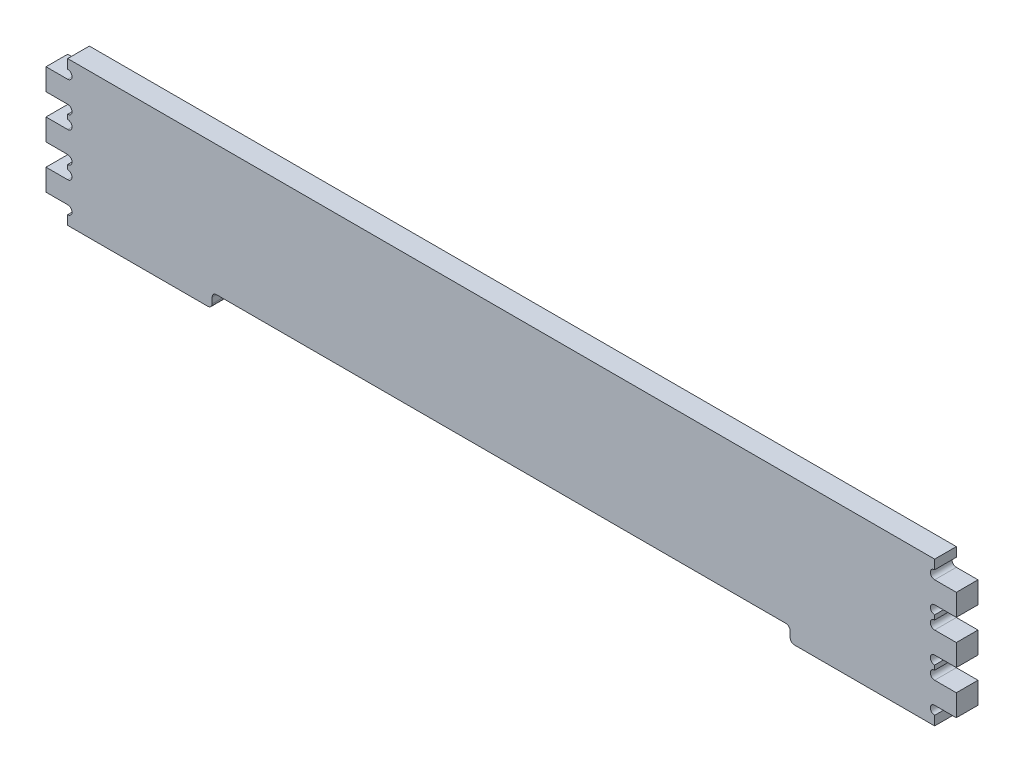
ISO-10303-21;
HEADER;
FILE_DESCRIPTION(('STEP AP214'),'2;1');
FILE_NAME('part.step','',(''),(''),'','','');
FILE_SCHEMA(('AUTOMOTIVE_DESIGN { 1 0 10303 214 1 1 1 1 }'));
ENDSEC;
DATA;
#1=APPLICATION_CONTEXT('core data for automotive mechanical design processes');
#2=APPLICATION_PROTOCOL_DEFINITION('international standard','automotive_design',2000,#1);
#3=PRODUCT_CONTEXT('',#1,'mechanical');
#4=PRODUCT('Part','Part','',(#3));
#5=PRODUCT_RELATED_PRODUCT_CATEGORY('part','',(#4));
#6=PRODUCT_DEFINITION_FORMATION('','',#4);
#7=PRODUCT_DEFINITION_CONTEXT('part definition',#1,'design');
#8=PRODUCT_DEFINITION('design','',#6,#7);
#9=PRODUCT_DEFINITION_SHAPE('','',#8);
#10=(LENGTH_UNIT() NAMED_UNIT(*) SI_UNIT(.MILLI.,.METRE.));
#11=(NAMED_UNIT(*) PLANE_ANGLE_UNIT() SI_UNIT($,.RADIAN.));
#12=(NAMED_UNIT(*) SI_UNIT($,.STERADIAN.) SOLID_ANGLE_UNIT());
#13=UNCERTAINTY_MEASURE_WITH_UNIT(LENGTH_MEASURE(1.E-05),#10,'distance_accuracy_value','');
#14=(GEOMETRIC_REPRESENTATION_CONTEXT(3) GLOBAL_UNCERTAINTY_ASSIGNED_CONTEXT((#13)) GLOBAL_UNIT_ASSIGNED_CONTEXT((#10,
#11,#12)) REPRESENTATION_CONTEXT('',''));
#15=CARTESIAN_POINT('',(0.,0.,0.));
#16=DIRECTION('',(0.,0.,1.));
#17=DIRECTION('',(1.,0.,0.));
#18=AXIS2_PLACEMENT_3D('',#15,#16,#17);
#19=CARTESIAN_POINT('',(0.,93.6,15.));
#20=DIRECTION('',(-1.,0.,0.));
#21=DIRECTION('',(0.,-1.,0.));
#22=AXIS2_PLACEMENT_3D('',#19,#20,#21);
#23=PLANE('',#22);
#24=DIRECTION('',(0.,1.,0.));
#25=VECTOR('',#24,1.);
#26=CARTESIAN_POINT('',(0.,93.6,0.));
#27=LINE('',#26,#25);
#28=CARTESIAN_POINT('',(0.,93.6,0.));
#29=VERTEX_POINT('',#28);
#30=CARTESIAN_POINT('',(0.,100.,0.));
#31=VERTEX_POINT('',#30);
#32=EDGE_CURVE('E491',#29,#31,#27,.T.);
#33=ORIENTED_EDGE('',*,*,#32,.F.);
#34=DIRECTION('',(0.,0.,-1.));
#35=VECTOR('',#34,1.);
#36=CARTESIAN_POINT('',(0.,93.6,15.));
#37=LINE('',#36,#35);
#38=CARTESIAN_POINT('',(0.,93.6,15.));
#39=VERTEX_POINT('',#38);
#40=EDGE_CURVE('E369',#39,#29,#37,.T.);
#41=ORIENTED_EDGE('',*,*,#40,.F.);
#42=DIRECTION('',(0.,1.,0.));
#43=VECTOR('',#42,1.);
#44=CARTESIAN_POINT('',(0.,93.6,15.));
#45=LINE('',#44,#43);
#46=CARTESIAN_POINT('',(0.,100.,15.));
#47=VERTEX_POINT('',#46);
#48=EDGE_CURVE('E365',#39,#47,#45,.T.);
#49=ORIENTED_EDGE('',*,*,#48,.T.);
#50=DIRECTION('',(0.,0.,-1.));
#51=VECTOR('',#50,1.);
#52=CARTESIAN_POINT('',(0.,100.,15.));
#53=LINE('',#52,#51);
#54=EDGE_CURVE('E348',#47,#31,#53,.T.);
#55=ORIENTED_EDGE('',*,*,#54,.T.);
#56=EDGE_LOOP('',(#33,#41,#49,#55));
#57=FACE_BOUND('',#56,.T.);
#58=ADVANCED_FACE('F39',(#57),#23,.T.);
#59=CARTESIAN_POINT('',(0.,90.6,15.));
#60=DIRECTION('',(0.,0.,-1.));
#61=DIRECTION('',(-1.,0.,0.));
#62=AXIS2_PLACEMENT_3D('',#59,#60,#61);
#63=CYLINDRICAL_SURFACE('',#62,3.);
#64=CARTESIAN_POINT('',(0.,90.6,0.));
#65=DIRECTION('',(0.,0.,-1.));
#66=DIRECTION('',(-1.,0.,0.));
#67=AXIS2_PLACEMENT_3D('',#64,#65,#66);
#68=CIRCLE('',#67,3.);
#69=CARTESIAN_POINT('',(0.,87.6,0.));
#70=VERTEX_POINT('',#69);
#71=EDGE_CURVE('E371',#29,#70,#68,.T.);
#72=ORIENTED_EDGE('',*,*,#71,.T.);
#73=DIRECTION('',(0.,0.,-1.));
#74=VECTOR('',#73,1.);
#75=CARTESIAN_POINT('',(0.,87.6,15.));
#76=LINE('',#75,#74);
#77=CARTESIAN_POINT('',(0.,87.6,15.));
#78=VERTEX_POINT('',#77);
#79=EDGE_CURVE('E621',#78,#70,#76,.T.);
#80=ORIENTED_EDGE('',*,*,#79,.F.);
#81=CARTESIAN_POINT('',(0.,90.6,15.));
#82=DIRECTION('',(0.,0.,-1.));
#83=DIRECTION('',(-1.,0.,0.));
#84=AXIS2_PLACEMENT_3D('',#81,#82,#83);
#85=CIRCLE('',#84,3.);
#86=EDGE_CURVE('E359',#39,#78,#85,.T.);
#87=ORIENTED_EDGE('',*,*,#86,.F.);
#88=ORIENTED_EDGE('',*,*,#40,.T.);
#89=EDGE_LOOP('',(#72,#80,#87,#88));
#90=FACE_BOUND('',#89,.T.);
#91=ADVANCED_FACE('F839',(#90),#63,.F.);
#92=CARTESIAN_POINT('',(-15.,87.6,15.));
#93=DIRECTION('',(0.,1.,0.));
#94=DIRECTION('',(-1.,0.,0.));
#95=AXIS2_PLACEMENT_3D('',#92,#93,#94);
#96=PLANE('',#95);
#97=DIRECTION('',(1.,0.,0.));
#98=VECTOR('',#97,1.);
#99=CARTESIAN_POINT('',(-15.,87.6,0.));
#100=LINE('',#99,#98);
#101=CARTESIAN_POINT('',(-15.,87.6,0.));
#102=VERTEX_POINT('',#101);
#103=EDGE_CURVE('E374',#102,#70,#100,.T.);
#104=ORIENTED_EDGE('',*,*,#103,.F.);
#105=DIRECTION('',(0.,0.,-1.));
#106=VECTOR('',#105,1.);
#107=CARTESIAN_POINT('',(-15.,87.6,15.));
#108=LINE('',#107,#106);
#109=CARTESIAN_POINT('',(-15.,87.6,15.));
#110=VERTEX_POINT('',#109);
#111=EDGE_CURVE('E623',#110,#102,#108,.T.);
#112=ORIENTED_EDGE('',*,*,#111,.F.);
#113=DIRECTION('',(1.,0.,0.));
#114=VECTOR('',#113,1.);
#115=CARTESIAN_POINT('',(-15.,87.6,15.));
#116=LINE('',#115,#114);
#117=EDGE_CURVE('E487',#110,#78,#116,.T.);
#118=ORIENTED_EDGE('',*,*,#117,.T.);
#119=ORIENTED_EDGE('',*,*,#79,.T.);
#120=EDGE_LOOP('',(#104,#112,#118,#119));
#121=FACE_BOUND('',#120,.T.);
#122=ADVANCED_FACE('F932',(#121),#96,.T.);
#123=CARTESIAN_POINT('',(-15.,72.6,15.));
#124=DIRECTION('',(-1.,0.,0.));
#125=DIRECTION('',(0.,-1.,0.));
#126=AXIS2_PLACEMENT_3D('',#123,#124,#125);
#127=PLANE('',#126);
#128=DIRECTION('',(0.,1.,0.));
#129=VECTOR('',#128,1.);
#130=CARTESIAN_POINT('',(-15.,72.6,0.));
#131=LINE('',#130,#129);
#132=CARTESIAN_POINT('',(-15.,72.6,0.));
#133=VERTEX_POINT('',#132);
#134=EDGE_CURVE('E614',#133,#102,#131,.T.);
#135=ORIENTED_EDGE('',*,*,#134,.F.);
#136=DIRECTION('',(0.,0.,-1.));
#137=VECTOR('',#136,1.);
#138=CARTESIAN_POINT('',(-15.,72.6,15.));
#139=LINE('',#138,#137);
#140=CARTESIAN_POINT('',(-15.,72.6,15.));
#141=VERTEX_POINT('',#140);
#142=EDGE_CURVE('E625',#141,#133,#139,.T.);
#143=ORIENTED_EDGE('',*,*,#142,.F.);
#144=DIRECTION('',(0.,1.,0.));
#145=VECTOR('',#144,1.);
#146=CARTESIAN_POINT('',(-15.,72.6,15.));
#147=LINE('',#146,#145);
#148=EDGE_CURVE('E484',#141,#110,#147,.T.);
#149=ORIENTED_EDGE('',*,*,#148,.T.);
#150=ORIENTED_EDGE('',*,*,#111,.T.);
#151=EDGE_LOOP('',(#135,#143,#149,#150));
#152=FACE_BOUND('',#151,.T.);
#153=ADVANCED_FACE('F846',(#152),#127,.T.);
#154=CARTESIAN_POINT('',(0.,72.6,15.));
#155=DIRECTION('',(0.,-1.,0.));
#156=DIRECTION('',(0.,0.,-1.));
#157=AXIS2_PLACEMENT_3D('',#154,#155,#156);
#158=PLANE('',#157);
#159=DIRECTION('',(-1.,0.,0.));
#160=VECTOR('',#159,1.);
#161=CARTESIAN_POINT('',(0.,72.6,0.));
#162=LINE('',#161,#160);
#163=CARTESIAN_POINT('',(0.,72.6,0.));
#164=VERTEX_POINT('',#163);
#165=EDGE_CURVE('E611',#164,#133,#162,.T.);
#166=ORIENTED_EDGE('',*,*,#165,.F.);
#167=DIRECTION('',(0.,0.,-1.));
#168=VECTOR('',#167,1.);
#169=CARTESIAN_POINT('',(0.,72.6,15.));
#170=LINE('',#169,#168);
#171=CARTESIAN_POINT('',(0.,72.6,15.));
#172=VERTEX_POINT('',#171);
#173=EDGE_CURVE('E627',#172,#164,#170,.T.);
#174=ORIENTED_EDGE('',*,*,#173,.F.);
#175=DIRECTION('',(-1.,0.,0.));
#176=VECTOR('',#175,1.);
#177=CARTESIAN_POINT('',(0.,72.6,15.));
#178=LINE('',#177,#176);
#179=EDGE_CURVE('E481',#172,#141,#178,.T.);
#180=ORIENTED_EDGE('',*,*,#179,.T.);
#181=ORIENTED_EDGE('',*,*,#142,.T.);
#182=EDGE_LOOP('',(#166,#174,#180,#181));
#183=FACE_BOUND('',#182,.T.);
#184=ADVANCED_FACE('F849',(#183),#158,.T.);
#185=CARTESIAN_POINT('',(0.,69.6,15.));
#186=DIRECTION('',(0.,0.,-1.));
#187=DIRECTION('',(-1.,0.,0.));
#188=AXIS2_PLACEMENT_3D('',#185,#186,#187);
#189=CYLINDRICAL_SURFACE('',#188,3.);
#190=CARTESIAN_POINT('',(0.,69.6,0.));
#191=DIRECTION('',(0.,0.,-1.));
#192=DIRECTION('',(-1.,0.,0.));
#193=AXIS2_PLACEMENT_3D('',#190,#191,#192);
#194=CIRCLE('',#193,3.);
#195=CARTESIAN_POINT('',(0.,66.6,0.));
#196=VERTEX_POINT('',#195);
#197=EDGE_CURVE('E608',#164,#196,#194,.T.);
#198=ORIENTED_EDGE('',*,*,#197,.T.);
#199=DIRECTION('',(0.,0.,-1.));
#200=VECTOR('',#199,1.);
#201=CARTESIAN_POINT('',(0.,66.6,15.));
#202=LINE('',#201,#200);
#203=CARTESIAN_POINT('',(0.,66.6,15.));
#204=VERTEX_POINT('',#203);
#205=EDGE_CURVE('E629',#204,#196,#202,.T.);
#206=ORIENTED_EDGE('',*,*,#205,.F.);
#207=CARTESIAN_POINT('',(0.,69.6,15.));
#208=DIRECTION('',(0.,0.,-1.));
#209=DIRECTION('',(-1.,0.,0.));
#210=AXIS2_PLACEMENT_3D('',#207,#208,#209);
#211=CIRCLE('',#210,3.);
#212=EDGE_CURVE('E479',#172,#204,#211,.T.);
#213=ORIENTED_EDGE('',*,*,#212,.F.);
#214=ORIENTED_EDGE('',*,*,#173,.T.);
#215=EDGE_LOOP('',(#198,#206,#213,#214));
#216=FACE_BOUND('',#215,.T.);
#217=ADVANCED_FACE('F854',(#216),#189,.F.);
#218=CARTESIAN_POINT('',(0.,63.5,15.));
#219=DIRECTION('',(-1.,0.,0.));
#220=DIRECTION('',(0.,0.,1.));
#221=AXIS2_PLACEMENT_3D('',#218,#219,#220);
#222=PLANE('',#221);
#223=DIRECTION('',(0.,1.,0.));
#224=VECTOR('',#223,1.);
#225=CARTESIAN_POINT('',(0.,63.5,0.));
#226=LINE('',#225,#224);
#227=CARTESIAN_POINT('',(0.,63.5,0.));
#228=VERTEX_POINT('',#227);
#229=EDGE_CURVE('E605',#228,#196,#226,.T.);
#230=ORIENTED_EDGE('',*,*,#229,.F.);
#231=DIRECTION('',(0.,0.,-1.));
#232=VECTOR('',#231,1.);
#233=CARTESIAN_POINT('',(0.,63.5,15.));
#234=LINE('',#233,#232);
#235=CARTESIAN_POINT('',(0.,63.5,15.));
#236=VERTEX_POINT('',#235);
#237=EDGE_CURVE('E631',#236,#228,#234,.T.);
#238=ORIENTED_EDGE('',*,*,#237,.F.);
#239=DIRECTION('',(0.,1.,0.));
#240=VECTOR('',#239,1.);
#241=CARTESIAN_POINT('',(0.,63.5,15.));
#242=LINE('',#241,#240);
#243=EDGE_CURVE('E476',#236,#204,#242,.T.);
#244=ORIENTED_EDGE('',*,*,#243,.T.);
#245=ORIENTED_EDGE('',*,*,#205,.T.);
#246=EDGE_LOOP('',(#230,#238,#244,#245));
#247=FACE_BOUND('',#246,.T.);
#248=ADVANCED_FACE('F858',(#247),#222,.T.);
#249=CARTESIAN_POINT('',(0.,60.5,15.));
#250=DIRECTION('',(0.,0.,-1.));
#251=DIRECTION('',(-1.,0.,0.));
#252=AXIS2_PLACEMENT_3D('',#249,#250,#251);
#253=CYLINDRICAL_SURFACE('',#252,3.);
#254=CARTESIAN_POINT('',(0.,60.5,0.));
#255=DIRECTION('',(0.,0.,-1.));
#256=DIRECTION('',(-1.,0.,0.));
#257=AXIS2_PLACEMENT_3D('',#254,#255,#256);
#258=CIRCLE('',#257,3.);
#259=CARTESIAN_POINT('',(0.,57.5,0.));
#260=VERTEX_POINT('',#259);
#261=EDGE_CURVE('E602',#228,#260,#258,.T.);
#262=ORIENTED_EDGE('',*,*,#261,.T.);
#263=DIRECTION('',(0.,0.,-1.));
#264=VECTOR('',#263,1.);
#265=CARTESIAN_POINT('',(0.,57.5,15.));
#266=LINE('',#265,#264);
#267=CARTESIAN_POINT('',(0.,57.5,15.));
#268=VERTEX_POINT('',#267);
#269=EDGE_CURVE('E633',#268,#260,#266,.T.);
#270=ORIENTED_EDGE('',*,*,#269,.F.);
#271=CARTESIAN_POINT('',(0.,60.5,15.));
#272=DIRECTION('',(0.,0.,-1.));
#273=DIRECTION('',(-1.,0.,0.));
#274=AXIS2_PLACEMENT_3D('',#271,#272,#273);
#275=CIRCLE('',#274,3.);
#276=EDGE_CURVE('E474',#236,#268,#275,.T.);
#277=ORIENTED_EDGE('',*,*,#276,.F.);
#278=ORIENTED_EDGE('',*,*,#237,.T.);
#279=EDGE_LOOP('',(#262,#270,#277,#278));
#280=FACE_BOUND('',#279,.T.);
#281=ADVANCED_FACE('F863',(#280),#253,.F.);
#282=CARTESIAN_POINT('',(-15.,57.5,15.));
#283=DIRECTION('',(0.,1.,0.));
#284=DIRECTION('',(-1.,0.,0.));
#285=AXIS2_PLACEMENT_3D('',#282,#283,#284);
#286=PLANE('',#285);
#287=DIRECTION('',(1.,0.,0.));
#288=VECTOR('',#287,1.);
#289=CARTESIAN_POINT('',(-15.,57.5,0.));
#290=LINE('',#289,#288);
#291=CARTESIAN_POINT('',(-15.,57.5,0.));
#292=VERTEX_POINT('',#291);
#293=EDGE_CURVE('E599',#292,#260,#290,.T.);
#294=ORIENTED_EDGE('',*,*,#293,.F.);
#295=DIRECTION('',(0.,0.,-1.));
#296=VECTOR('',#295,1.);
#297=CARTESIAN_POINT('',(-15.,57.5,15.));
#298=LINE('',#297,#296);
#299=CARTESIAN_POINT('',(-15.,57.5,15.));
#300=VERTEX_POINT('',#299);
#301=EDGE_CURVE('E635',#300,#292,#298,.T.);
#302=ORIENTED_EDGE('',*,*,#301,.F.);
#303=DIRECTION('',(1.,0.,0.));
#304=VECTOR('',#303,1.);
#305=CARTESIAN_POINT('',(-15.,57.5,15.));
#306=LINE('',#305,#304);
#307=EDGE_CURVE('E471',#300,#268,#306,.T.);
#308=ORIENTED_EDGE('',*,*,#307,.T.);
#309=ORIENTED_EDGE('',*,*,#269,.T.);
#310=EDGE_LOOP('',(#294,#302,#308,#309));
#311=FACE_BOUND('',#310,.T.);
#312=ADVANCED_FACE('F918',(#311),#286,.T.);
#313=CARTESIAN_POINT('',(-15.,42.5,15.));
#314=DIRECTION('',(-1.,0.,0.));
#315=DIRECTION('',(0.,0.,1.));
#316=AXIS2_PLACEMENT_3D('',#313,#314,#315);
#317=PLANE('',#316);
#318=DIRECTION('',(0.,1.,0.));
#319=VECTOR('',#318,1.);
#320=CARTESIAN_POINT('',(-15.,42.5,0.));
#321=LINE('',#320,#319);
#322=CARTESIAN_POINT('',(-15.,42.5,0.));
#323=VERTEX_POINT('',#322);
#324=EDGE_CURVE('E596',#323,#292,#321,.T.);
#325=ORIENTED_EDGE('',*,*,#324,.F.);
#326=DIRECTION('',(0.,0.,-1.));
#327=VECTOR('',#326,1.);
#328=CARTESIAN_POINT('',(-15.,42.5,15.));
#329=LINE('',#328,#327);
#330=CARTESIAN_POINT('',(-15.,42.5,15.));
#331=VERTEX_POINT('',#330);
#332=EDGE_CURVE('E637',#331,#323,#329,.T.);
#333=ORIENTED_EDGE('',*,*,#332,.F.);
#334=DIRECTION('',(0.,1.,0.));
#335=VECTOR('',#334,1.);
#336=CARTESIAN_POINT('',(-15.,42.5,15.));
#337=LINE('',#336,#335);
#338=EDGE_CURVE('E468',#331,#300,#337,.T.);
#339=ORIENTED_EDGE('',*,*,#338,.T.);
#340=ORIENTED_EDGE('',*,*,#301,.T.);
#341=EDGE_LOOP('',(#325,#333,#339,#340));
#342=FACE_BOUND('',#341,.T.);
#343=ADVANCED_FACE('F870',(#342),#317,.T.);
#344=CARTESIAN_POINT('',(0.,42.5,15.));
#345=DIRECTION('',(0.,-1.,0.));
#346=DIRECTION('',(0.,0.,-1.));
#347=AXIS2_PLACEMENT_3D('',#344,#345,#346);
#348=PLANE('',#347);
#349=DIRECTION('',(-1.,0.,0.));
#350=VECTOR('',#349,1.);
#351=CARTESIAN_POINT('',(0.,42.5,0.));
#352=LINE('',#351,#350);
#353=CARTESIAN_POINT('',(0.,42.5,0.));
#354=VERTEX_POINT('',#353);
#355=EDGE_CURVE('E593',#354,#323,#352,.T.);
#356=ORIENTED_EDGE('',*,*,#355,.F.);
#357=DIRECTION('',(0.,0.,-1.));
#358=VECTOR('',#357,1.);
#359=CARTESIAN_POINT('',(0.,42.5,15.));
#360=LINE('',#359,#358);
#361=CARTESIAN_POINT('',(0.,42.5,15.));
#362=VERTEX_POINT('',#361);
#363=EDGE_CURVE('E639',#362,#354,#360,.T.);
#364=ORIENTED_EDGE('',*,*,#363,.F.);
#365=DIRECTION('',(-1.,0.,0.));
#366=VECTOR('',#365,1.);
#367=CARTESIAN_POINT('',(0.,42.5,15.));
#368=LINE('',#367,#366);
#369=EDGE_CURVE('E465',#362,#331,#368,.T.);
#370=ORIENTED_EDGE('',*,*,#369,.T.);
#371=ORIENTED_EDGE('',*,*,#332,.T.);
#372=EDGE_LOOP('',(#356,#364,#370,#371));
#373=FACE_BOUND('',#372,.T.);
#374=ADVANCED_FACE('F874',(#373),#348,.T.);
#375=CARTESIAN_POINT('',(0.,39.5,15.));
#376=DIRECTION('',(0.,0.,-1.));
#377=DIRECTION('',(-1.,0.,0.));
#378=AXIS2_PLACEMENT_3D('',#375,#376,#377);
#379=CYLINDRICAL_SURFACE('',#378,3.);
#380=CARTESIAN_POINT('',(0.,39.5,0.));
#381=DIRECTION('',(0.,0.,1.));
#382=DIRECTION('',(1.,0.,0.));
#383=AXIS2_PLACEMENT_3D('',#380,#381,#382);
#384=CIRCLE('',#383,3.);
#385=CARTESIAN_POINT('',(0.,36.5,0.));
#386=VERTEX_POINT('',#385);
#387=EDGE_CURVE('E590',#386,#354,#384,.T.);
#388=ORIENTED_EDGE('',*,*,#387,.F.);
#389=DIRECTION('',(0.,0.,-1.));
#390=VECTOR('',#389,1.);
#391=CARTESIAN_POINT('',(0.,36.5,15.));
#392=LINE('',#391,#390);
#393=CARTESIAN_POINT('',(0.,36.5,15.));
#394=VERTEX_POINT('',#393);
#395=EDGE_CURVE('E641',#394,#386,#392,.T.);
#396=ORIENTED_EDGE('',*,*,#395,.F.);
#397=CARTESIAN_POINT('',(0.,39.5,15.));
#398=DIRECTION('',(0.,0.,1.));
#399=DIRECTION('',(1.,0.,0.));
#400=AXIS2_PLACEMENT_3D('',#397,#398,#399);
#401=CIRCLE('',#400,3.);
#402=EDGE_CURVE('E462',#394,#362,#401,.T.);
#403=ORIENTED_EDGE('',*,*,#402,.T.);
#404=ORIENTED_EDGE('',*,*,#363,.T.);
#405=EDGE_LOOP('',(#388,#396,#403,#404));
#406=FACE_BOUND('',#405,.T.);
#407=ADVANCED_FACE('F879',(#406),#379,.F.);
#408=CARTESIAN_POINT('',(0.,33.4,15.));
#409=DIRECTION('',(-1.,0.,0.));
#410=DIRECTION('',(0.,0.,1.));
#411=AXIS2_PLACEMENT_3D('',#408,#409,#410);
#412=PLANE('',#411);
#413=DIRECTION('',(0.,1.,0.));
#414=VECTOR('',#413,1.);
#415=CARTESIAN_POINT('',(0.,33.4,0.));
#416=LINE('',#415,#414);
#417=CARTESIAN_POINT('',(0.,33.4,0.));
#418=VERTEX_POINT('',#417);
#419=EDGE_CURVE('E587',#418,#386,#416,.T.);
#420=ORIENTED_EDGE('',*,*,#419,.F.);
#421=DIRECTION('',(0.,0.,-1.));
#422=VECTOR('',#421,1.);
#423=CARTESIAN_POINT('',(0.,33.4,15.));
#424=LINE('',#423,#422);
#425=CARTESIAN_POINT('',(0.,33.4,15.));
#426=VERTEX_POINT('',#425);
#427=EDGE_CURVE('E643',#426,#418,#424,.T.);
#428=ORIENTED_EDGE('',*,*,#427,.F.);
#429=DIRECTION('',(0.,1.,0.));
#430=VECTOR('',#429,1.);
#431=CARTESIAN_POINT('',(0.,33.4,15.));
#432=LINE('',#431,#430);
#433=EDGE_CURVE('E459',#426,#394,#432,.T.);
#434=ORIENTED_EDGE('',*,*,#433,.T.);
#435=ORIENTED_EDGE('',*,*,#395,.T.);
#436=EDGE_LOOP('',(#420,#428,#434,#435));
#437=FACE_BOUND('',#436,.T.);
#438=ADVANCED_FACE('F882',(#437),#412,.T.);
#439=CARTESIAN_POINT('',(0.,30.4,15.));
#440=DIRECTION('',(0.,0.,-1.));
#441=DIRECTION('',(-1.,0.,0.));
#442=AXIS2_PLACEMENT_3D('',#439,#440,#441);
#443=CYLINDRICAL_SURFACE('',#442,3.);
#444=CARTESIAN_POINT('',(0.,30.4,0.));
#445=DIRECTION('',(0.,0.,1.));
#446=DIRECTION('',(1.,0.,0.));
#447=AXIS2_PLACEMENT_3D('',#444,#445,#446);
#448=CIRCLE('',#447,3.);
#449=CARTESIAN_POINT('',(0.,27.4,0.));
#450=VERTEX_POINT('',#449);
#451=EDGE_CURVE('E584',#450,#418,#448,.T.);
#452=ORIENTED_EDGE('',*,*,#451,.F.);
#453=DIRECTION('',(0.,0.,-1.));
#454=VECTOR('',#453,1.);
#455=CARTESIAN_POINT('',(0.,27.4,15.));
#456=LINE('',#455,#454);
#457=CARTESIAN_POINT('',(0.,27.4,15.));
#458=VERTEX_POINT('',#457);
#459=EDGE_CURVE('E645',#458,#450,#456,.T.);
#460=ORIENTED_EDGE('',*,*,#459,.F.);
#461=CARTESIAN_POINT('',(0.,30.4,15.));
#462=DIRECTION('',(0.,0.,1.));
#463=DIRECTION('',(1.,0.,0.));
#464=AXIS2_PLACEMENT_3D('',#461,#462,#463);
#465=CIRCLE('',#464,3.);
#466=EDGE_CURVE('E456',#458,#426,#465,.T.);
#467=ORIENTED_EDGE('',*,*,#466,.T.);
#468=ORIENTED_EDGE('',*,*,#427,.T.);
#469=EDGE_LOOP('',(#452,#460,#467,#468));
#470=FACE_BOUND('',#469,.T.);
#471=ADVANCED_FACE('F886',(#470),#443,.F.);
#472=CARTESIAN_POINT('',(0.,27.4,15.));
#473=DIRECTION('',(0.,-1.,0.));
#474=DIRECTION('',(1.,0.,0.));
#475=AXIS2_PLACEMENT_3D('',#472,#473,#474);
#476=PLANE('',#475);
#477=DIRECTION('',(-1.,0.,0.));
#478=VECTOR('',#477,1.);
#479=CARTESIAN_POINT('',(0.,27.4,0.));
#480=LINE('',#479,#478);
#481=CARTESIAN_POINT('',(-15.,27.4,0.));
#482=VERTEX_POINT('',#481);
#483=EDGE_CURVE('E581',#450,#482,#480,.T.);
#484=ORIENTED_EDGE('',*,*,#483,.T.);
#485=DIRECTION('',(0.,0.,-1.));
#486=VECTOR('',#485,1.);
#487=CARTESIAN_POINT('',(-15.,27.4,15.));
#488=LINE('',#487,#486);
#489=CARTESIAN_POINT('',(-15.,27.4,15.));
#490=VERTEX_POINT('',#489);
#491=EDGE_CURVE('E647',#490,#482,#488,.T.);
#492=ORIENTED_EDGE('',*,*,#491,.F.);
#493=DIRECTION('',(-1.,0.,0.));
#494=VECTOR('',#493,1.);
#495=CARTESIAN_POINT('',(0.,27.4,15.));
#496=LINE('',#495,#494);
#497=EDGE_CURVE('E454',#458,#490,#496,.T.);
#498=ORIENTED_EDGE('',*,*,#497,.F.);
#499=ORIENTED_EDGE('',*,*,#459,.T.);
#500=EDGE_LOOP('',(#484,#492,#498,#499));
#501=FACE_BOUND('',#500,.T.);
#502=ADVANCED_FACE('F891',(#501),#476,.F.);
#503=CARTESIAN_POINT('',(-15.,12.4,15.));
#504=DIRECTION('',(-1.,0.,0.));
#505=DIRECTION('',(0.,0.,1.));
#506=AXIS2_PLACEMENT_3D('',#503,#504,#505);
#507=PLANE('',#506);
#508=DIRECTION('',(0.,1.,0.));
#509=VECTOR('',#508,1.);
#510=CARTESIAN_POINT('',(-15.,12.4,0.));
#511=LINE('',#510,#509);
#512=CARTESIAN_POINT('',(-15.,12.4,0.));
#513=VERTEX_POINT('',#512);
#514=EDGE_CURVE('E578',#513,#482,#511,.T.);
#515=ORIENTED_EDGE('',*,*,#514,.F.);
#516=DIRECTION('',(0.,0.,-1.));
#517=VECTOR('',#516,1.);
#518=CARTESIAN_POINT('',(-15.,12.4,15.));
#519=LINE('',#518,#517);
#520=CARTESIAN_POINT('',(-15.,12.4,15.));
#521=VERTEX_POINT('',#520);
#522=EDGE_CURVE('E649',#521,#513,#519,.T.);
#523=ORIENTED_EDGE('',*,*,#522,.F.);
#524=DIRECTION('',(0.,1.,0.));
#525=VECTOR('',#524,1.);
#526=CARTESIAN_POINT('',(-15.,12.4,15.));
#527=LINE('',#526,#525);
#528=EDGE_CURVE('E451',#521,#490,#527,.T.);
#529=ORIENTED_EDGE('',*,*,#528,.T.);
#530=ORIENTED_EDGE('',*,*,#491,.T.);
#531=EDGE_LOOP('',(#515,#523,#529,#530));
#532=FACE_BOUND('',#531,.T.);
#533=ADVANCED_FACE('F897',(#532),#507,.T.);
#534=CARTESIAN_POINT('',(-15.,12.4,15.));
#535=DIRECTION('',(0.,1.,0.));
#536=DIRECTION('',(0.,0.,1.));
#537=AXIS2_PLACEMENT_3D('',#534,#535,#536);
#538=PLANE('',#537);
#539=DIRECTION('',(1.,0.,0.));
#540=VECTOR('',#539,1.);
#541=CARTESIAN_POINT('',(-15.,12.4,0.));
#542=LINE('',#541,#540);
#543=CARTESIAN_POINT('',(0.,12.4,0.));
#544=VERTEX_POINT('',#543);
#545=EDGE_CURVE('E576',#513,#544,#542,.T.);
#546=ORIENTED_EDGE('',*,*,#545,.T.);
#547=DIRECTION('',(0.,0.,-1.));
#548=VECTOR('',#547,1.);
#549=CARTESIAN_POINT('',(0.,12.4,15.));
#550=LINE('',#549,#548);
#551=CARTESIAN_POINT('',(0.,12.4,15.));
#552=VERTEX_POINT('',#551);
#553=EDGE_CURVE('E651',#552,#544,#550,.T.);
#554=ORIENTED_EDGE('',*,*,#553,.F.);
#555=DIRECTION('',(1.,0.,0.));
#556=VECTOR('',#555,1.);
#557=CARTESIAN_POINT('',(-15.,12.4,15.));
#558=LINE('',#557,#556);
#559=EDGE_CURVE('E449',#521,#552,#558,.T.);
#560=ORIENTED_EDGE('',*,*,#559,.F.);
#561=ORIENTED_EDGE('',*,*,#522,.T.);
#562=EDGE_LOOP('',(#546,#554,#560,#561));
#563=FACE_BOUND('',#562,.T.);
#564=ADVANCED_FACE('F900',(#563),#538,.F.);
#565=CARTESIAN_POINT('',(0.,9.4,15.));
#566=DIRECTION('',(0.,0.,-1.));
#567=DIRECTION('',(-1.,0.,0.));
#568=AXIS2_PLACEMENT_3D('',#565,#566,#567);
#569=CYLINDRICAL_SURFACE('',#568,3.);
#570=CARTESIAN_POINT('',(0.,9.4,0.));
#571=DIRECTION('',(0.,0.,-1.));
#572=DIRECTION('',(-1.,0.,0.));
#573=AXIS2_PLACEMENT_3D('',#570,#571,#572);
#574=CIRCLE('',#573,3.);
#575=CARTESIAN_POINT('',(0.,6.4,0.));
#576=VERTEX_POINT('',#575);
#577=EDGE_CURVE('E574',#544,#576,#574,.T.);
#578=ORIENTED_EDGE('',*,*,#577,.T.);
#579=DIRECTION('',(0.,0.,-1.));
#580=VECTOR('',#579,1.);
#581=CARTESIAN_POINT('',(0.,6.4,15.));
#582=LINE('',#581,#580);
#583=CARTESIAN_POINT('',(0.,6.4,15.));
#584=VERTEX_POINT('',#583);
#585=EDGE_CURVE('E654',#584,#576,#582,.T.);
#586=ORIENTED_EDGE('',*,*,#585,.F.);
#587=CARTESIAN_POINT('',(0.,9.4,15.));
#588=DIRECTION('',(0.,0.,-1.));
#589=DIRECTION('',(-1.,0.,0.));
#590=AXIS2_PLACEMENT_3D('',#587,#588,#589);
#591=CIRCLE('',#590,3.);
#592=EDGE_CURVE('E447',#552,#584,#591,.T.);
#593=ORIENTED_EDGE('',*,*,#592,.F.);
#594=ORIENTED_EDGE('',*,*,#553,.T.);
#595=EDGE_LOOP('',(#578,#586,#593,#594));
#596=FACE_BOUND('',#595,.T.);
#597=ADVANCED_FACE('F905',(#596),#569,.F.);
#598=CARTESIAN_POINT('',(0.,6.4,15.));
#599=DIRECTION('',(1.,0.,0.));
#600=DIRECTION('',(0.,0.,-1.));
#601=AXIS2_PLACEMENT_3D('',#598,#599,#600);
#602=PLANE('',#601);
#603=DIRECTION('',(0.,-1.,0.));
#604=VECTOR('',#603,1.);
#605=CARTESIAN_POINT('',(0.,6.4,0.));
#606=LINE('',#605,#604);
#607=CARTESIAN_POINT('',(0.,0.,0.));
#608=VERTEX_POINT('',#607);
#609=EDGE_CURVE('E571',#576,#608,#606,.T.);
#610=ORIENTED_EDGE('',*,*,#609,.T.);
#611=DIRECTION('',(0.,0.,-1.));
#612=VECTOR('',#611,1.);
#613=CARTESIAN_POINT('',(0.,0.,15.));
#614=LINE('',#613,#612);
#615=CARTESIAN_POINT('',(0.,0.,15.));
#616=VERTEX_POINT('',#615);
#617=EDGE_CURVE('E657',#616,#608,#614,.T.);
#618=ORIENTED_EDGE('',*,*,#617,.F.);
#619=DIRECTION('',(0.,-1.,0.));
#620=VECTOR('',#619,1.);
#621=CARTESIAN_POINT('',(0.,6.4,15.));
#622=LINE('',#621,#620);
#623=EDGE_CURVE('E444',#584,#616,#622,.T.);
#624=ORIENTED_EDGE('',*,*,#623,.F.);
#625=ORIENTED_EDGE('',*,*,#585,.T.);
#626=EDGE_LOOP('',(#610,#618,#624,#625));
#627=FACE_BOUND('',#626,.T.);
#628=ADVANCED_FACE('F911',(#627),#602,.F.);
#629=CARTESIAN_POINT('',(100.,0.,15.));
#630=DIRECTION('',(0.,-1.,0.));
#631=DIRECTION('',(0.,0.,-1.));
#632=AXIS2_PLACEMENT_3D('',#629,#630,#631);
#633=PLANE('',#632);
#634=DIRECTION('',(-1.,0.,0.));
#635=VECTOR('',#634,1.);
#636=CARTESIAN_POINT('',(100.,0.,0.));
#637=LINE('',#636,#635);
#638=CARTESIAN_POINT('',(97.,0.,0.));
#639=VERTEX_POINT('',#638);
#640=EDGE_CURVE('E569',#639,#608,#637,.T.);
#641=ORIENTED_EDGE('',*,*,#640,.F.);
#642=DIRECTION('',(0.,0.,-1.));
#643=VECTOR('',#642,1.);
#644=CARTESIAN_POINT('',(97.,0.,15.));
#645=LINE('',#644,#643);
#646=CARTESIAN_POINT('',(97.,0.,15.));
#647=VERTEX_POINT('',#646);
#648=EDGE_CURVE('E725',#639,#647,#645,.F.);
#649=ORIENTED_EDGE('',*,*,#648,.T.);
#650=DIRECTION('',(-1.,0.,0.));
#651=VECTOR('',#650,1.);
#652=CARTESIAN_POINT('',(100.,0.,15.));
#653=LINE('',#652,#651);
#654=EDGE_CURVE('E442',#647,#616,#653,.T.);
#655=ORIENTED_EDGE('',*,*,#654,.T.);
#656=ORIENTED_EDGE('',*,*,#617,.T.);
#657=EDGE_LOOP('',(#641,#649,#655,#656));
#658=FACE_BOUND('',#657,.T.);
#659=ADVANCED_FACE('F915',(#658),#633,.T.);
#660=CARTESIAN_POINT('',(100.,10.,15.));
#661=DIRECTION('',(1.,0.,0.));
#662=DIRECTION('',(0.,0.,-1.));
#663=AXIS2_PLACEMENT_3D('',#660,#661,#662);
#664=PLANE('',#663);
#665=DIRECTION('',(0.,-1.,0.));
#666=VECTOR('',#665,1.);
#667=CARTESIAN_POINT('',(100.,10.,0.));
#668=LINE('',#667,#666);
#669=CARTESIAN_POINT('',(100.,7.,0.));
#670=VERTEX_POINT('',#669);
#671=CARTESIAN_POINT('',(100.,3.,0.));
#672=VERTEX_POINT('',#671);
#673=EDGE_CURVE('E566',#670,#672,#668,.T.);
#674=ORIENTED_EDGE('',*,*,#673,.F.);
#675=DIRECTION('',(0.,0.,-1.));
#676=VECTOR('',#675,1.);
#677=CARTESIAN_POINT('',(100.,7.,15.));
#678=LINE('',#677,#676);
#679=CARTESIAN_POINT('',(100.,7.,15.));
#680=VERTEX_POINT('',#679);
#681=EDGE_CURVE('E723',#670,#680,#678,.F.);
#682=ORIENTED_EDGE('',*,*,#681,.T.);
#683=DIRECTION('',(0.,-1.,0.));
#684=VECTOR('',#683,1.);
#685=CARTESIAN_POINT('',(100.,10.,15.));
#686=LINE('',#685,#684);
#687=CARTESIAN_POINT('',(100.,3.,15.));
#688=VERTEX_POINT('',#687);
#689=EDGE_CURVE('E439',#680,#688,#686,.T.);
#690=ORIENTED_EDGE('',*,*,#689,.T.);
#691=DIRECTION('',(0.,0.,-1.));
#692=VECTOR('',#691,1.);
#693=CARTESIAN_POINT('',(100.,3.,15.));
#694=LINE('',#693,#692);
#695=EDGE_CURVE('E720',#688,#672,#694,.T.);
#696=ORIENTED_EDGE('',*,*,#695,.T.);
#697=EDGE_LOOP('',(#674,#682,#690,#696));
#698=FACE_BOUND('',#697,.T.);
#699=ADVANCED_FACE('F737',(#698),#664,.T.);
#700=CARTESIAN_POINT('',(500.,10.,15.));
#701=DIRECTION('',(0.,-1.,0.));
#702=DIRECTION('',(1.,0.,0.));
#703=AXIS2_PLACEMENT_3D('',#700,#701,#702);
#704=PLANE('',#703);
#705=DIRECTION('',(-1.,0.,0.));
#706=VECTOR('',#705,1.);
#707=CARTESIAN_POINT('',(500.,10.,0.));
#708=LINE('',#707,#706);
#709=CARTESIAN_POINT('',(497.,10.,0.));
#710=VERTEX_POINT('',#709);
#711=CARTESIAN_POINT('',(103.,10.,0.));
#712=VERTEX_POINT('',#711);
#713=EDGE_CURVE('E563',#710,#712,#708,.T.);
#714=ORIENTED_EDGE('',*,*,#713,.F.);
#715=DIRECTION('',(0.,0.,-1.));
#716=VECTOR('',#715,1.);
#717=CARTESIAN_POINT('',(497.,10.,15.));
#718=LINE('',#717,#716);
#719=CARTESIAN_POINT('',(497.,10.,15.));
#720=VERTEX_POINT('',#719);
#721=EDGE_CURVE('E59',#710,#720,#718,.F.);
#722=ORIENTED_EDGE('',*,*,#721,.T.);
#723=DIRECTION('',(-1.,0.,0.));
#724=VECTOR('',#723,1.);
#725=CARTESIAN_POINT('',(500.,10.,15.));
#726=LINE('',#725,#724);
#727=CARTESIAN_POINT('',(103.,10.,15.));
#728=VERTEX_POINT('',#727);
#729=EDGE_CURVE('E437',#720,#728,#726,.T.);
#730=ORIENTED_EDGE('',*,*,#729,.T.);
#731=DIRECTION('',(0.,0.,-1.));
#732=VECTOR('',#731,1.);
#733=CARTESIAN_POINT('',(103.,10.,0.));
#734=LINE('',#733,#732);
#735=EDGE_CURVE('E716',#728,#712,#734,.T.);
#736=ORIENTED_EDGE('',*,*,#735,.T.);
#737=EDGE_LOOP('',(#714,#722,#730,#736));
#738=FACE_BOUND('',#737,.T.);
#739=ADVANCED_FACE('F740',(#738),#704,.T.);
#740=CARTESIAN_POINT('',(500.,0.,15.));
#741=DIRECTION('',(-1.,0.,0.));
#742=DIRECTION('',(0.,0.,1.));
#743=AXIS2_PLACEMENT_3D('',#740,#741,#742);
#744=PLANE('',#743);
#745=DIRECTION('',(0.,1.,0.));
#746=VECTOR('',#745,1.);
#747=CARTESIAN_POINT('',(500.,0.,0.));
#748=LINE('',#747,#746);
#749=CARTESIAN_POINT('',(500.,2.99999999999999,0.));
#750=VERTEX_POINT('',#749);
#751=CARTESIAN_POINT('',(500.,7.00000000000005,0.));
#752=VERTEX_POINT('',#751);
#753=EDGE_CURVE('E560',#750,#752,#748,.T.);
#754=ORIENTED_EDGE('',*,*,#753,.F.);
#755=DIRECTION('',(0.,0.,-1.));
#756=VECTOR('',#755,1.);
#757=CARTESIAN_POINT('',(500.,2.99999999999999,15.));
#758=LINE('',#757,#756);
#759=CARTESIAN_POINT('',(500.,2.99999999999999,15.));
#760=VERTEX_POINT('',#759);
#761=EDGE_CURVE('E710',#750,#760,#758,.F.);
#762=ORIENTED_EDGE('',*,*,#761,.T.);
#763=DIRECTION('',(0.,1.,0.));
#764=VECTOR('',#763,1.);
#765=CARTESIAN_POINT('',(500.,0.,15.));
#766=LINE('',#765,#764);
#767=CARTESIAN_POINT('',(500.,7.00000000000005,15.));
#768=VERTEX_POINT('',#767);
#769=EDGE_CURVE('E434',#760,#768,#766,.T.);
#770=ORIENTED_EDGE('',*,*,#769,.T.);
#771=DIRECTION('',(0.,0.,-1.));
#772=VECTOR('',#771,1.);
#773=CARTESIAN_POINT('',(500.,7.00000000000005,0.));
#774=LINE('',#773,#772);
#775=EDGE_CURVE('E707',#768,#752,#774,.T.);
#776=ORIENTED_EDGE('',*,*,#775,.T.);
#777=EDGE_LOOP('',(#754,#762,#770,#776));
#778=FACE_BOUND('',#777,.T.);
#779=ADVANCED_FACE('F747',(#778),#744,.T.);
#780=CARTESIAN_POINT('',(600.,0.,15.));
#781=DIRECTION('',(0.,-1.,0.));
#782=DIRECTION('',(1.,0.,0.));
#783=AXIS2_PLACEMENT_3D('',#780,#781,#782);
#784=PLANE('',#783);
#785=DIRECTION('',(-1.,0.,0.));
#786=VECTOR('',#785,1.);
#787=CARTESIAN_POINT('',(600.,0.,15.));
#788=LINE('',#787,#786);
#789=CARTESIAN_POINT('',(600.,0.,15.));
#790=VERTEX_POINT('',#789);
#791=CARTESIAN_POINT('',(503.,0.,15.));
#792=VERTEX_POINT('',#791);
#793=EDGE_CURVE('E430',#790,#792,#788,.T.);
#794=ORIENTED_EDGE('',*,*,#793,.T.);
#795=DIRECTION('',(0.,0.,-1.));
#796=VECTOR('',#795,1.);
#797=CARTESIAN_POINT('',(503.,0.,15.));
#798=LINE('',#797,#796);
#799=CARTESIAN_POINT('',(503.,0.,0.));
#800=VERTEX_POINT('',#799);
#801=EDGE_CURVE('E620',#792,#800,#798,.T.);
#802=ORIENTED_EDGE('',*,*,#801,.T.);
#803=DIRECTION('',(-1.,0.,0.));
#804=VECTOR('',#803,1.);
#805=CARTESIAN_POINT('',(600.,0.,0.));
#806=LINE('',#805,#804);
#807=CARTESIAN_POINT('',(600.,0.,0.));
#808=VERTEX_POINT('',#807);
#809=EDGE_CURVE('E556',#808,#800,#806,.T.);
#810=ORIENTED_EDGE('',*,*,#809,.F.);
#811=DIRECTION('',(0.,0.,-1.));
#812=VECTOR('',#811,1.);
#813=CARTESIAN_POINT('',(600.,0.,15.));
#814=LINE('',#813,#812);
#815=EDGE_CURVE('E660',#790,#808,#814,.T.);
#816=ORIENTED_EDGE('',*,*,#815,.F.);
#817=EDGE_LOOP('',(#794,#802,#810,#816));
#818=FACE_BOUND('',#817,.T.);
#819=ADVANCED_FACE('F755',(#818),#784,.T.);
#820=CARTESIAN_POINT('',(600.,6.39999999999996,15.));
#821=DIRECTION('',(1.,0.,0.));
#822=DIRECTION('',(0.,0.,-1.));
#823=AXIS2_PLACEMENT_3D('',#820,#821,#822);
#824=PLANE('',#823);
#825=DIRECTION('',(0.,-1.,0.));
#826=VECTOR('',#825,1.);
#827=CARTESIAN_POINT('',(600.,6.39999999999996,0.));
#828=LINE('',#827,#826);
#829=CARTESIAN_POINT('',(600.,6.39999999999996,0.));
#830=VERTEX_POINT('',#829);
#831=EDGE_CURVE('E553',#830,#808,#828,.T.);
#832=ORIENTED_EDGE('',*,*,#831,.F.);
#833=DIRECTION('',(0.,0.,-1.));
#834=VECTOR('',#833,1.);
#835=CARTESIAN_POINT('',(600.,6.39999999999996,15.));
#836=LINE('',#835,#834);
#837=CARTESIAN_POINT('',(600.,6.39999999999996,15.));
#838=VERTEX_POINT('',#837);
#839=EDGE_CURVE('E662',#838,#830,#836,.T.);
#840=ORIENTED_EDGE('',*,*,#839,.F.);
#841=DIRECTION('',(0.,-1.,0.));
#842=VECTOR('',#841,1.);
#843=CARTESIAN_POINT('',(600.,6.39999999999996,15.));
#844=LINE('',#843,#842);
#845=EDGE_CURVE('E427',#838,#790,#844,.T.);
#846=ORIENTED_EDGE('',*,*,#845,.T.);
#847=ORIENTED_EDGE('',*,*,#815,.T.);
#848=EDGE_LOOP('',(#832,#840,#846,#847));
#849=FACE_BOUND('',#848,.T.);
#850=ADVANCED_FACE('F760',(#849),#824,.T.);
#851=CARTESIAN_POINT('',(600.,9.39999999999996,15.));
#852=DIRECTION('',(0.,0.,-1.));
#853=DIRECTION('',(-1.,0.,0.));
#854=AXIS2_PLACEMENT_3D('',#851,#852,#853);
#855=CYLINDRICAL_SURFACE('',#854,3.);
#856=CARTESIAN_POINT('',(600.,9.39999999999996,0.));
#857=DIRECTION('',(0.,0.,-1.));
#858=DIRECTION('',(-1.,0.,0.));
#859=AXIS2_PLACEMENT_3D('',#856,#857,#858);
#860=CIRCLE('',#859,3.);
#861=CARTESIAN_POINT('',(600.,12.4,0.));
#862=VERTEX_POINT('',#861);
#863=EDGE_CURVE('E549',#830,#862,#860,.T.);
#864=ORIENTED_EDGE('',*,*,#863,.T.);
#865=DIRECTION('',(0.,0.,-1.));
#866=VECTOR('',#865,1.);
#867=CARTESIAN_POINT('',(600.,12.4,15.));
#868=LINE('',#867,#866);
#869=CARTESIAN_POINT('',(600.,12.4,15.));
#870=VERTEX_POINT('',#869);
#871=EDGE_CURVE('E664',#870,#862,#868,.T.);
#872=ORIENTED_EDGE('',*,*,#871,.F.);
#873=CARTESIAN_POINT('',(600.,9.39999999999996,15.));
#874=DIRECTION('',(0.,0.,-1.));
#875=DIRECTION('',(-1.,0.,0.));
#876=AXIS2_PLACEMENT_3D('',#873,#874,#875);
#877=CIRCLE('',#876,3.);
#878=EDGE_CURVE('E425',#838,#870,#877,.T.);
#879=ORIENTED_EDGE('',*,*,#878,.F.);
#880=ORIENTED_EDGE('',*,*,#839,.T.);
#881=EDGE_LOOP('',(#864,#872,#879,#880));
#882=FACE_BOUND('',#881,.T.);
#883=ADVANCED_FACE('F765',(#882),#855,.F.);
#884=CARTESIAN_POINT('',(615.,12.4,15.));
#885=DIRECTION('',(0.,-1.,0.));
#886=DIRECTION('',(1.,0.,0.));
#887=AXIS2_PLACEMENT_3D('',#884,#885,#886);
#888=PLANE('',#887);
#889=DIRECTION('',(-1.,0.,0.));
#890=VECTOR('',#889,1.);
#891=CARTESIAN_POINT('',(615.,12.4,0.));
#892=LINE('',#891,#890);
#893=CARTESIAN_POINT('',(615.,12.4,0.));
#894=VERTEX_POINT('',#893);
#895=EDGE_CURVE('E546',#894,#862,#892,.T.);
#896=ORIENTED_EDGE('',*,*,#895,.F.);
#897=DIRECTION('',(0.,0.,-1.));
#898=VECTOR('',#897,1.);
#899=CARTESIAN_POINT('',(615.,12.4,15.));
#900=LINE('',#899,#898);
#901=CARTESIAN_POINT('',(615.,12.4,15.));
#902=VERTEX_POINT('',#901);
#903=EDGE_CURVE('E666',#902,#894,#900,.T.);
#904=ORIENTED_EDGE('',*,*,#903,.F.);
#905=DIRECTION('',(-1.,0.,0.));
#906=VECTOR('',#905,1.);
#907=CARTESIAN_POINT('',(615.,12.4,15.));
#908=LINE('',#907,#906);
#909=EDGE_CURVE('E422',#902,#870,#908,.T.);
#910=ORIENTED_EDGE('',*,*,#909,.T.);
#911=ORIENTED_EDGE('',*,*,#871,.T.);
#912=EDGE_LOOP('',(#896,#904,#910,#911));
#913=FACE_BOUND('',#912,.T.);
#914=ADVANCED_FACE('F1159',(#913),#888,.T.);
#915=CARTESIAN_POINT('',(615.,27.4,15.));
#916=DIRECTION('',(1.,0.,0.));
#917=DIRECTION('',(0.,0.,-1.));
#918=AXIS2_PLACEMENT_3D('',#915,#916,#917);
#919=PLANE('',#918);
#920=DIRECTION('',(0.,-1.,0.));
#921=VECTOR('',#920,1.);
#922=CARTESIAN_POINT('',(615.,27.4,0.));
#923=LINE('',#922,#921);
#924=CARTESIAN_POINT('',(615.,27.4,0.));
#925=VERTEX_POINT('',#924);
#926=EDGE_CURVE('E543',#925,#894,#923,.T.);
#927=ORIENTED_EDGE('',*,*,#926,.F.);
#928=DIRECTION('',(0.,0.,-1.));
#929=VECTOR('',#928,1.);
#930=CARTESIAN_POINT('',(615.,27.4,15.));
#931=LINE('',#930,#929);
#932=CARTESIAN_POINT('',(615.,27.4,15.));
#933=VERTEX_POINT('',#932);
#934=EDGE_CURVE('E668',#933,#925,#931,.T.);
#935=ORIENTED_EDGE('',*,*,#934,.F.);
#936=DIRECTION('',(0.,-1.,0.));
#937=VECTOR('',#936,1.);
#938=CARTESIAN_POINT('',(615.,27.4,15.));
#939=LINE('',#938,#937);
#940=EDGE_CURVE('E419',#933,#902,#939,.T.);
#941=ORIENTED_EDGE('',*,*,#940,.T.);
#942=ORIENTED_EDGE('',*,*,#903,.T.);
#943=EDGE_LOOP('',(#927,#935,#941,#942));
#944=FACE_BOUND('',#943,.T.);
#945=ADVANCED_FACE('F772',(#944),#919,.T.);
#946=CARTESIAN_POINT('',(600.,27.4,15.));
#947=DIRECTION('',(0.,1.,0.));
#948=DIRECTION('',(0.,0.,1.));
#949=AXIS2_PLACEMENT_3D('',#946,#947,#948);
#950=PLANE('',#949);
#951=DIRECTION('',(1.,0.,0.));
#952=VECTOR('',#951,1.);
#953=CARTESIAN_POINT('',(600.,27.4,0.));
#954=LINE('',#953,#952);
#955=CARTESIAN_POINT('',(600.,27.4,0.));
#956=VERTEX_POINT('',#955);
#957=EDGE_CURVE('E539',#956,#925,#954,.T.);
#958=ORIENTED_EDGE('',*,*,#957,.F.);
#959=DIRECTION('',(0.,0.,-1.));
#960=VECTOR('',#959,1.);
#961=CARTESIAN_POINT('',(600.,27.4,15.));
#962=LINE('',#961,#960);
#963=CARTESIAN_POINT('',(600.,27.4,15.));
#964=VERTEX_POINT('',#963);
#965=EDGE_CURVE('E670',#964,#956,#962,.T.);
#966=ORIENTED_EDGE('',*,*,#965,.F.);
#967=DIRECTION('',(1.,0.,0.));
#968=VECTOR('',#967,1.);
#969=CARTESIAN_POINT('',(600.,27.4,15.));
#970=LINE('',#969,#968);
#971=EDGE_CURVE('E415',#964,#933,#970,.T.);
#972=ORIENTED_EDGE('',*,*,#971,.T.);
#973=ORIENTED_EDGE('',*,*,#934,.T.);
#974=EDGE_LOOP('',(#958,#966,#972,#973));
#975=FACE_BOUND('',#974,.T.);
#976=ADVANCED_FACE('F776',(#975),#950,.T.);
#977=CARTESIAN_POINT('',(600.,30.4,15.));
#978=DIRECTION('',(0.,0.,-1.));
#979=DIRECTION('',(-1.,0.,0.));
#980=AXIS2_PLACEMENT_3D('',#977,#978,#979);
#981=CYLINDRICAL_SURFACE('',#980,3.);
#982=CARTESIAN_POINT('',(600.,30.4,0.));
#983=DIRECTION('',(0.,0.,-1.));
#984=DIRECTION('',(-1.,0.,0.));
#985=AXIS2_PLACEMENT_3D('',#982,#983,#984);
#986=CIRCLE('',#985,3.);
#987=CARTESIAN_POINT('',(600.,33.4,0.));
#988=VERTEX_POINT('',#987);
#989=EDGE_CURVE('E535',#956,#988,#986,.T.);
#990=ORIENTED_EDGE('',*,*,#989,.T.);
#991=DIRECTION('',(0.,0.,-1.));
#992=VECTOR('',#991,1.);
#993=CARTESIAN_POINT('',(600.,33.4,15.));
#994=LINE('',#993,#992);
#995=CARTESIAN_POINT('',(600.,33.4,15.));
#996=VERTEX_POINT('',#995);
#997=EDGE_CURVE('E673',#996,#988,#994,.T.);
#998=ORIENTED_EDGE('',*,*,#997,.F.);
#999=CARTESIAN_POINT('',(600.,30.4,15.));
#1000=DIRECTION('',(0.,0.,-1.));
#1001=DIRECTION('',(-1.,0.,0.));
#1002=AXIS2_PLACEMENT_3D('',#999,#1000,#1001);
#1003=CIRCLE('',#1002,3.);
#1004=EDGE_CURVE('E412',#964,#996,#1003,.T.);
#1005=ORIENTED_EDGE('',*,*,#1004,.F.);
#1006=ORIENTED_EDGE('',*,*,#965,.T.);
#1007=EDGE_LOOP('',(#990,#998,#1005,#1006));
#1008=FACE_BOUND('',#1007,.T.);
#1009=ADVANCED_FACE('F781',(#1008),#981,.F.);
#1010=CARTESIAN_POINT('',(600.,36.5,15.));
#1011=DIRECTION('',(1.,0.,0.));
#1012=DIRECTION('',(0.,0.,-1.));
#1013=AXIS2_PLACEMENT_3D('',#1010,#1011,#1012);
#1014=PLANE('',#1013);
#1015=DIRECTION('',(0.,-1.,0.));
#1016=VECTOR('',#1015,1.);
#1017=CARTESIAN_POINT('',(600.,36.5,0.));
#1018=LINE('',#1017,#1016);
#1019=CARTESIAN_POINT('',(600.,36.5,0.));
#1020=VERTEX_POINT('',#1019);
#1021=EDGE_CURVE('E531',#1020,#988,#1018,.T.);
#1022=ORIENTED_EDGE('',*,*,#1021,.F.);
#1023=DIRECTION('',(0.,0.,-1.));
#1024=VECTOR('',#1023,1.);
#1025=CARTESIAN_POINT('',(600.,36.5,15.));
#1026=LINE('',#1025,#1024);
#1027=CARTESIAN_POINT('',(600.,36.5,15.));
#1028=VERTEX_POINT('',#1027);
#1029=EDGE_CURVE('E676',#1028,#1020,#1026,.T.);
#1030=ORIENTED_EDGE('',*,*,#1029,.F.);
#1031=DIRECTION('',(0.,-1.,0.));
#1032=VECTOR('',#1031,1.);
#1033=CARTESIAN_POINT('',(600.,36.5,15.));
#1034=LINE('',#1033,#1032);
#1035=EDGE_CURVE('E408',#1028,#996,#1034,.T.);
#1036=ORIENTED_EDGE('',*,*,#1035,.T.);
#1037=ORIENTED_EDGE('',*,*,#997,.T.);
#1038=EDGE_LOOP('',(#1022,#1030,#1036,#1037));
#1039=FACE_BOUND('',#1038,.T.);
#1040=ADVANCED_FACE('F785',(#1039),#1014,.T.);
#1041=CARTESIAN_POINT('',(600.,39.5,15.));
#1042=DIRECTION('',(0.,0.,-1.));
#1043=DIRECTION('',(-1.,0.,0.));
#1044=AXIS2_PLACEMENT_3D('',#1041,#1042,#1043);
#1045=CYLINDRICAL_SURFACE('',#1044,3.);
#1046=CARTESIAN_POINT('',(600.,39.5,0.));
#1047=DIRECTION('',(0.,0.,-1.));
#1048=DIRECTION('',(-1.,0.,0.));
#1049=AXIS2_PLACEMENT_3D('',#1046,#1047,#1048);
#1050=CIRCLE('',#1049,3.);
#1051=CARTESIAN_POINT('',(600.,42.5,0.));
#1052=VERTEX_POINT('',#1051);
#1053=EDGE_CURVE('E527',#1020,#1052,#1050,.T.);
#1054=ORIENTED_EDGE('',*,*,#1053,.T.);
#1055=DIRECTION('',(0.,0.,-1.));
#1056=VECTOR('',#1055,1.);
#1057=CARTESIAN_POINT('',(600.,42.5,15.));
#1058=LINE('',#1057,#1056);
#1059=CARTESIAN_POINT('',(600.,42.5,15.));
#1060=VERTEX_POINT('',#1059);
#1061=EDGE_CURVE('E678',#1060,#1052,#1058,.T.);
#1062=ORIENTED_EDGE('',*,*,#1061,.F.);
#1063=CARTESIAN_POINT('',(600.,39.5,15.));
#1064=DIRECTION('',(0.,0.,-1.));
#1065=DIRECTION('',(-1.,0.,0.));
#1066=AXIS2_PLACEMENT_3D('',#1063,#1064,#1065);
#1067=CIRCLE('',#1066,3.);
#1068=EDGE_CURVE('E405',#1028,#1060,#1067,.T.);
#1069=ORIENTED_EDGE('',*,*,#1068,.F.);
#1070=ORIENTED_EDGE('',*,*,#1029,.T.);
#1071=EDGE_LOOP('',(#1054,#1062,#1069,#1070));
#1072=FACE_BOUND('',#1071,.T.);
#1073=ADVANCED_FACE('F790',(#1072),#1045,.F.);
#1074=CARTESIAN_POINT('',(615.,42.5,15.));
#1075=DIRECTION('',(0.,-1.,0.));
#1076=DIRECTION('',(0.,0.,-1.));
#1077=AXIS2_PLACEMENT_3D('',#1074,#1075,#1076);
#1078=PLANE('',#1077);
#1079=DIRECTION('',(-1.,0.,0.));
#1080=VECTOR('',#1079,1.);
#1081=CARTESIAN_POINT('',(615.,42.5,0.));
#1082=LINE('',#1081,#1080);
#1083=CARTESIAN_POINT('',(615.,42.5,0.));
#1084=VERTEX_POINT('',#1083);
#1085=EDGE_CURVE('E524',#1084,#1052,#1082,.T.);
#1086=ORIENTED_EDGE('',*,*,#1085,.F.);
#1087=DIRECTION('',(0.,0.,-1.));
#1088=VECTOR('',#1087,1.);
#1089=CARTESIAN_POINT('',(615.,42.5,15.));
#1090=LINE('',#1089,#1088);
#1091=CARTESIAN_POINT('',(615.,42.5,15.));
#1092=VERTEX_POINT('',#1091);
#1093=EDGE_CURVE('E680',#1092,#1084,#1090,.T.);
#1094=ORIENTED_EDGE('',*,*,#1093,.F.);
#1095=DIRECTION('',(-1.,0.,0.));
#1096=VECTOR('',#1095,1.);
#1097=CARTESIAN_POINT('',(615.,42.5,15.));
#1098=LINE('',#1097,#1096);
#1099=EDGE_CURVE('E402',#1092,#1060,#1098,.T.);
#1100=ORIENTED_EDGE('',*,*,#1099,.T.);
#1101=ORIENTED_EDGE('',*,*,#1061,.T.);
#1102=EDGE_LOOP('',(#1086,#1094,#1100,#1101));
#1103=FACE_BOUND('',#1102,.T.);
#1104=ADVANCED_FACE('F1110',(#1103),#1078,.T.);
#1105=CARTESIAN_POINT('',(615.,57.5,15.));
#1106=DIRECTION('',(1.,0.,0.));
#1107=DIRECTION('',(0.,0.,-1.));
#1108=AXIS2_PLACEMENT_3D('',#1105,#1106,#1107);
#1109=PLANE('',#1108);
#1110=DIRECTION('',(0.,-1.,0.));
#1111=VECTOR('',#1110,1.);
#1112=CARTESIAN_POINT('',(615.,57.5,0.));
#1113=LINE('',#1112,#1111);
#1114=CARTESIAN_POINT('',(615.,57.5,0.));
#1115=VERTEX_POINT('',#1114);
#1116=EDGE_CURVE('E521',#1115,#1084,#1113,.T.);
#1117=ORIENTED_EDGE('',*,*,#1116,.F.);
#1118=DIRECTION('',(0.,0.,-1.));
#1119=VECTOR('',#1118,1.);
#1120=CARTESIAN_POINT('',(615.,57.5,15.));
#1121=LINE('',#1120,#1119);
#1122=CARTESIAN_POINT('',(615.,57.5,15.));
#1123=VERTEX_POINT('',#1122);
#1124=EDGE_CURVE('E682',#1123,#1115,#1121,.T.);
#1125=ORIENTED_EDGE('',*,*,#1124,.F.);
#1126=DIRECTION('',(0.,-1.,0.));
#1127=VECTOR('',#1126,1.);
#1128=CARTESIAN_POINT('',(615.,57.5,15.));
#1129=LINE('',#1128,#1127);
#1130=EDGE_CURVE('E399',#1123,#1092,#1129,.T.);
#1131=ORIENTED_EDGE('',*,*,#1130,.T.);
#1132=ORIENTED_EDGE('',*,*,#1093,.T.);
#1133=EDGE_LOOP('',(#1117,#1125,#1131,#1132));
#1134=FACE_BOUND('',#1133,.T.);
#1135=ADVANCED_FACE('F797',(#1134),#1109,.T.);
#1136=CARTESIAN_POINT('',(600.,57.5,15.));
#1137=DIRECTION('',(0.,1.,0.));
#1138=DIRECTION('',(0.,0.,1.));
#1139=AXIS2_PLACEMENT_3D('',#1136,#1137,#1138);
#1140=PLANE('',#1139);
#1141=DIRECTION('',(1.,0.,0.));
#1142=VECTOR('',#1141,1.);
#1143=CARTESIAN_POINT('',(600.,57.5,0.));
#1144=LINE('',#1143,#1142);
#1145=CARTESIAN_POINT('',(600.,57.5,0.));
#1146=VERTEX_POINT('',#1145);
#1147=EDGE_CURVE('E518',#1146,#1115,#1144,.T.);
#1148=ORIENTED_EDGE('',*,*,#1147,.F.);
#1149=DIRECTION('',(0.,0.,-1.));
#1150=VECTOR('',#1149,1.);
#1151=CARTESIAN_POINT('',(600.,57.5,15.));
#1152=LINE('',#1151,#1150);
#1153=CARTESIAN_POINT('',(600.,57.5,15.));
#1154=VERTEX_POINT('',#1153);
#1155=EDGE_CURVE('E684',#1154,#1146,#1152,.T.);
#1156=ORIENTED_EDGE('',*,*,#1155,.F.);
#1157=DIRECTION('',(1.,0.,0.));
#1158=VECTOR('',#1157,1.);
#1159=CARTESIAN_POINT('',(600.,57.5,15.));
#1160=LINE('',#1159,#1158);
#1161=EDGE_CURVE('E396',#1154,#1123,#1160,.T.);
#1162=ORIENTED_EDGE('',*,*,#1161,.T.);
#1163=ORIENTED_EDGE('',*,*,#1124,.T.);
#1164=EDGE_LOOP('',(#1148,#1156,#1162,#1163));
#1165=FACE_BOUND('',#1164,.T.);
#1166=ADVANCED_FACE('F801',(#1165),#1140,.T.);
#1167=CARTESIAN_POINT('',(600.,60.5,15.));
#1168=DIRECTION('',(0.,0.,-1.));
#1169=DIRECTION('',(-1.,0.,0.));
#1170=AXIS2_PLACEMENT_3D('',#1167,#1168,#1169);
#1171=CYLINDRICAL_SURFACE('',#1170,3.00000000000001);
#1172=CARTESIAN_POINT('',(600.,60.5,0.));
#1173=DIRECTION('',(0.,0.,-1.));
#1174=DIRECTION('',(-1.,0.,0.));
#1175=AXIS2_PLACEMENT_3D('',#1172,#1173,#1174);
#1176=CIRCLE('',#1175,3.00000000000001);
#1177=CARTESIAN_POINT('',(600.,63.5,0.));
#1178=VERTEX_POINT('',#1177);
#1179=EDGE_CURVE('E515',#1146,#1178,#1176,.T.);
#1180=ORIENTED_EDGE('',*,*,#1179,.T.);
#1181=DIRECTION('',(0.,0.,-1.));
#1182=VECTOR('',#1181,1.);
#1183=CARTESIAN_POINT('',(600.,63.5,15.));
#1184=LINE('',#1183,#1182);
#1185=CARTESIAN_POINT('',(600.,63.5,15.));
#1186=VERTEX_POINT('',#1185);
#1187=EDGE_CURVE('E686',#1186,#1178,#1184,.T.);
#1188=ORIENTED_EDGE('',*,*,#1187,.F.);
#1189=CARTESIAN_POINT('',(600.,60.5,15.));
#1190=DIRECTION('',(0.,0.,-1.));
#1191=DIRECTION('',(-1.,0.,0.));
#1192=AXIS2_PLACEMENT_3D('',#1189,#1190,#1191);
#1193=CIRCLE('',#1192,3.00000000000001);
#1194=EDGE_CURVE('E394',#1154,#1186,#1193,.T.);
#1195=ORIENTED_EDGE('',*,*,#1194,.F.);
#1196=ORIENTED_EDGE('',*,*,#1155,.T.);
#1197=EDGE_LOOP('',(#1180,#1188,#1195,#1196));
#1198=FACE_BOUND('',#1197,.T.);
#1199=ADVANCED_FACE('F806',(#1198),#1171,.F.);
#1200=CARTESIAN_POINT('',(600.,66.6,15.));
#1201=DIRECTION('',(1.,0.,0.));
#1202=DIRECTION('',(0.,0.,-1.));
#1203=AXIS2_PLACEMENT_3D('',#1200,#1201,#1202);
#1204=PLANE('',#1203);
#1205=DIRECTION('',(0.,-1.,0.));
#1206=VECTOR('',#1205,1.);
#1207=CARTESIAN_POINT('',(600.,66.6,0.));
#1208=LINE('',#1207,#1206);
#1209=CARTESIAN_POINT('',(600.,66.6,0.));
#1210=VERTEX_POINT('',#1209);
#1211=EDGE_CURVE('E512',#1210,#1178,#1208,.T.);
#1212=ORIENTED_EDGE('',*,*,#1211,.F.);
#1213=DIRECTION('',(0.,0.,-1.));
#1214=VECTOR('',#1213,1.);
#1215=CARTESIAN_POINT('',(600.,66.6,15.));
#1216=LINE('',#1215,#1214);
#1217=CARTESIAN_POINT('',(600.,66.6,15.));
#1218=VERTEX_POINT('',#1217);
#1219=EDGE_CURVE('E688',#1218,#1210,#1216,.T.);
#1220=ORIENTED_EDGE('',*,*,#1219,.F.);
#1221=DIRECTION('',(0.,-1.,0.));
#1222=VECTOR('',#1221,1.);
#1223=CARTESIAN_POINT('',(600.,66.6,15.));
#1224=LINE('',#1223,#1222);
#1225=EDGE_CURVE('E391',#1218,#1186,#1224,.T.);
#1226=ORIENTED_EDGE('',*,*,#1225,.T.);
#1227=ORIENTED_EDGE('',*,*,#1187,.T.);
#1228=EDGE_LOOP('',(#1212,#1220,#1226,#1227));
#1229=FACE_BOUND('',#1228,.T.);
#1230=ADVANCED_FACE('F810',(#1229),#1204,.T.);
#1231=CARTESIAN_POINT('',(600.,69.6,15.));
#1232=DIRECTION('',(0.,0.,-1.));
#1233=DIRECTION('',(-1.,0.,0.));
#1234=AXIS2_PLACEMENT_3D('',#1231,#1232,#1233);
#1235=CYLINDRICAL_SURFACE('',#1234,3.);
#1236=CARTESIAN_POINT('',(600.,69.6,0.));
#1237=DIRECTION('',(0.,0.,-1.));
#1238=DIRECTION('',(-1.,0.,0.));
#1239=AXIS2_PLACEMENT_3D('',#1236,#1237,#1238);
#1240=CIRCLE('',#1239,3.);
#1241=CARTESIAN_POINT('',(600.,72.6,0.));
#1242=VERTEX_POINT('',#1241);
#1243=EDGE_CURVE('E509',#1210,#1242,#1240,.T.);
#1244=ORIENTED_EDGE('',*,*,#1243,.T.);
#1245=DIRECTION('',(0.,0.,-1.));
#1246=VECTOR('',#1245,1.);
#1247=CARTESIAN_POINT('',(600.,72.6,15.));
#1248=LINE('',#1247,#1246);
#1249=CARTESIAN_POINT('',(600.,72.6,15.));
#1250=VERTEX_POINT('',#1249);
#1251=EDGE_CURVE('E690',#1250,#1242,#1248,.T.);
#1252=ORIENTED_EDGE('',*,*,#1251,.F.);
#1253=CARTESIAN_POINT('',(600.,69.6,15.));
#1254=DIRECTION('',(0.,0.,-1.));
#1255=DIRECTION('',(-1.,0.,0.));
#1256=AXIS2_PLACEMENT_3D('',#1253,#1254,#1255);
#1257=CIRCLE('',#1256,3.);
#1258=EDGE_CURVE('E389',#1218,#1250,#1257,.T.);
#1259=ORIENTED_EDGE('',*,*,#1258,.F.);
#1260=ORIENTED_EDGE('',*,*,#1219,.T.);
#1261=EDGE_LOOP('',(#1244,#1252,#1259,#1260));
#1262=FACE_BOUND('',#1261,.T.);
#1263=ADVANCED_FACE('F815',(#1262),#1235,.F.);
#1264=CARTESIAN_POINT('',(615.,72.6,15.));
#1265=DIRECTION('',(0.,-1.,0.));
#1266=DIRECTION('',(0.,0.,-1.));
#1267=AXIS2_PLACEMENT_3D('',#1264,#1265,#1266);
#1268=PLANE('',#1267);
#1269=DIRECTION('',(-1.,0.,0.));
#1270=VECTOR('',#1269,1.);
#1271=CARTESIAN_POINT('',(615.,72.6,0.));
#1272=LINE('',#1271,#1270);
#1273=CARTESIAN_POINT('',(615.,72.6,0.));
#1274=VERTEX_POINT('',#1273);
#1275=EDGE_CURVE('E506',#1274,#1242,#1272,.T.);
#1276=ORIENTED_EDGE('',*,*,#1275,.F.);
#1277=DIRECTION('',(0.,0.,-1.));
#1278=VECTOR('',#1277,1.);
#1279=CARTESIAN_POINT('',(615.,72.6,15.));
#1280=LINE('',#1279,#1278);
#1281=CARTESIAN_POINT('',(615.,72.6,15.));
#1282=VERTEX_POINT('',#1281);
#1283=EDGE_CURVE('E692',#1282,#1274,#1280,.T.);
#1284=ORIENTED_EDGE('',*,*,#1283,.F.);
#1285=DIRECTION('',(-1.,0.,0.));
#1286=VECTOR('',#1285,1.);
#1287=CARTESIAN_POINT('',(615.,72.6,15.));
#1288=LINE('',#1287,#1286);
#1289=EDGE_CURVE('E386',#1282,#1250,#1288,.T.);
#1290=ORIENTED_EDGE('',*,*,#1289,.T.);
#1291=ORIENTED_EDGE('',*,*,#1251,.T.);
#1292=EDGE_LOOP('',(#1276,#1284,#1290,#1291));
#1293=FACE_BOUND('',#1292,.T.);
#1294=ADVANCED_FACE('F1061',(#1293),#1268,.T.);
#1295=CARTESIAN_POINT('',(615.,87.6,15.));
#1296=DIRECTION('',(1.,0.,0.));
#1297=DIRECTION('',(0.,0.,-1.));
#1298=AXIS2_PLACEMENT_3D('',#1295,#1296,#1297);
#1299=PLANE('',#1298);
#1300=DIRECTION('',(0.,-1.,0.));
#1301=VECTOR('',#1300,1.);
#1302=CARTESIAN_POINT('',(615.,87.6,0.));
#1303=LINE('',#1302,#1301);
#1304=CARTESIAN_POINT('',(615.,87.6,0.));
#1305=VERTEX_POINT('',#1304);
#1306=EDGE_CURVE('E503',#1305,#1274,#1303,.T.);
#1307=ORIENTED_EDGE('',*,*,#1306,.F.);
#1308=DIRECTION('',(0.,0.,-1.));
#1309=VECTOR('',#1308,1.);
#1310=CARTESIAN_POINT('',(615.,87.6,15.));
#1311=LINE('',#1310,#1309);
#1312=CARTESIAN_POINT('',(615.,87.6,15.));
#1313=VERTEX_POINT('',#1312);
#1314=EDGE_CURVE('E694',#1313,#1305,#1311,.T.);
#1315=ORIENTED_EDGE('',*,*,#1314,.F.);
#1316=DIRECTION('',(0.,-1.,0.));
#1317=VECTOR('',#1316,1.);
#1318=CARTESIAN_POINT('',(615.,87.6,15.));
#1319=LINE('',#1318,#1317);
#1320=EDGE_CURVE('E383',#1313,#1282,#1319,.T.);
#1321=ORIENTED_EDGE('',*,*,#1320,.T.);
#1322=ORIENTED_EDGE('',*,*,#1283,.T.);
#1323=EDGE_LOOP('',(#1307,#1315,#1321,#1322));
#1324=FACE_BOUND('',#1323,.T.);
#1325=ADVANCED_FACE('F822',(#1324),#1299,.T.);
#1326=CARTESIAN_POINT('',(600.,87.6,15.));
#1327=DIRECTION('',(0.,1.,0.));
#1328=DIRECTION('',(-1.,0.,0.));
#1329=AXIS2_PLACEMENT_3D('',#1326,#1327,#1328);
#1330=PLANE('',#1329);
#1331=DIRECTION('',(1.,0.,0.));
#1332=VECTOR('',#1331,1.);
#1333=CARTESIAN_POINT('',(600.,87.6,0.));
#1334=LINE('',#1333,#1332);
#1335=CARTESIAN_POINT('',(600.,87.6,0.));
#1336=VERTEX_POINT('',#1335);
#1337=EDGE_CURVE('E500',#1336,#1305,#1334,.T.);
#1338=ORIENTED_EDGE('',*,*,#1337,.F.);
#1339=DIRECTION('',(0.,0.,-1.));
#1340=VECTOR('',#1339,1.);
#1341=CARTESIAN_POINT('',(600.,87.6,15.));
#1342=LINE('',#1341,#1340);
#1343=CARTESIAN_POINT('',(600.,87.6,15.));
#1344=VERTEX_POINT('',#1343);
#1345=EDGE_CURVE('E696',#1344,#1336,#1342,.T.);
#1346=ORIENTED_EDGE('',*,*,#1345,.F.);
#1347=DIRECTION('',(1.,0.,0.));
#1348=VECTOR('',#1347,1.);
#1349=CARTESIAN_POINT('',(600.,87.6,15.));
#1350=LINE('',#1349,#1348);
#1351=EDGE_CURVE('E380',#1344,#1313,#1350,.T.);
#1352=ORIENTED_EDGE('',*,*,#1351,.T.);
#1353=ORIENTED_EDGE('',*,*,#1314,.T.);
#1354=EDGE_LOOP('',(#1338,#1346,#1352,#1353));
#1355=FACE_BOUND('',#1354,.T.);
#1356=ADVANCED_FACE('F826',(#1355),#1330,.T.);
#1357=CARTESIAN_POINT('',(600.,90.6,15.));
#1358=DIRECTION('',(0.,0.,-1.));
#1359=DIRECTION('',(-1.,0.,0.));
#1360=AXIS2_PLACEMENT_3D('',#1357,#1358,#1359);
#1361=CYLINDRICAL_SURFACE('',#1360,3.);
#1362=CARTESIAN_POINT('',(600.,90.6,0.));
#1363=DIRECTION('',(0.,0.,-1.));
#1364=DIRECTION('',(-1.,0.,0.));
#1365=AXIS2_PLACEMENT_3D('',#1362,#1363,#1364);
#1366=CIRCLE('',#1365,3.);
#1367=CARTESIAN_POINT('',(600.,93.6,0.));
#1368=VERTEX_POINT('',#1367);
#1369=EDGE_CURVE('E497',#1336,#1368,#1366,.T.);
#1370=ORIENTED_EDGE('',*,*,#1369,.T.);
#1371=DIRECTION('',(0.,0.,-1.));
#1372=VECTOR('',#1371,1.);
#1373=CARTESIAN_POINT('',(600.,93.6,15.));
#1374=LINE('',#1373,#1372);
#1375=CARTESIAN_POINT('',(600.,93.6,15.));
#1376=VERTEX_POINT('',#1375);
#1377=EDGE_CURVE('E698',#1376,#1368,#1374,.T.);
#1378=ORIENTED_EDGE('',*,*,#1377,.F.);
#1379=CARTESIAN_POINT('',(600.,90.6,15.));
#1380=DIRECTION('',(0.,0.,-1.));
#1381=DIRECTION('',(-1.,0.,0.));
#1382=AXIS2_PLACEMENT_3D('',#1379,#1380,#1381);
#1383=CIRCLE('',#1382,3.);
#1384=EDGE_CURVE('E378',#1344,#1376,#1383,.T.);
#1385=ORIENTED_EDGE('',*,*,#1384,.F.);
#1386=ORIENTED_EDGE('',*,*,#1345,.T.);
#1387=EDGE_LOOP('',(#1370,#1378,#1385,#1386));
#1388=FACE_BOUND('',#1387,.T.);
#1389=ADVANCED_FACE('F830',(#1388),#1361,.F.);
#1390=CARTESIAN_POINT('',(600.,100.,15.));
#1391=DIRECTION('',(1.,0.,0.));
#1392=DIRECTION('',(0.,0.,-1.));
#1393=AXIS2_PLACEMENT_3D('',#1390,#1391,#1392);
#1394=PLANE('',#1393);
#1395=DIRECTION('',(0.,-1.,0.));
#1396=VECTOR('',#1395,1.);
#1397=CARTESIAN_POINT('',(600.,100.,0.));
#1398=LINE('',#1397,#1396);
#1399=CARTESIAN_POINT('',(600.,100.,0.));
#1400=VERTEX_POINT('',#1399);
#1401=EDGE_CURVE('E494',#1400,#1368,#1398,.T.);
#1402=ORIENTED_EDGE('',*,*,#1401,.F.);
#1403=DIRECTION('',(0.,0.,-1.));
#1404=VECTOR('',#1403,1.);
#1405=CARTESIAN_POINT('',(600.,100.,15.));
#1406=LINE('',#1405,#1404);
#1407=CARTESIAN_POINT('',(600.,100.,15.));
#1408=VERTEX_POINT('',#1407);
#1409=EDGE_CURVE('E358',#1408,#1400,#1406,.T.);
#1410=ORIENTED_EDGE('',*,*,#1409,.F.);
#1411=DIRECTION('',(0.,-1.,0.));
#1412=VECTOR('',#1411,1.);
#1413=CARTESIAN_POINT('',(600.,100.,15.));
#1414=LINE('',#1413,#1412);
#1415=EDGE_CURVE('E367',#1408,#1376,#1414,.T.);
#1416=ORIENTED_EDGE('',*,*,#1415,.T.);
#1417=ORIENTED_EDGE('',*,*,#1377,.T.);
#1418=EDGE_LOOP('',(#1402,#1410,#1416,#1417));
#1419=FACE_BOUND('',#1418,.T.);
#1420=ADVANCED_FACE('F834',(#1419),#1394,.T.);
#1421=CARTESIAN_POINT('',(0.,100.,15.));
#1422=DIRECTION('',(0.,1.,0.));
#1423=DIRECTION('',(0.,0.,1.));
#1424=AXIS2_PLACEMENT_3D('',#1421,#1422,#1423);
#1425=PLANE('',#1424);
#1426=DIRECTION('',(1.,0.,0.));
#1427=VECTOR('',#1426,1.);
#1428=CARTESIAN_POINT('',(0.,100.,0.));
#1429=LINE('',#1428,#1427);
#1430=EDGE_CURVE('E353',#31,#1400,#1429,.T.);
#1431=ORIENTED_EDGE('',*,*,#1430,.F.);
#1432=ORIENTED_EDGE('',*,*,#54,.F.);
#1433=DIRECTION('',(1.,0.,0.));
#1434=VECTOR('',#1433,1.);
#1435=CARTESIAN_POINT('',(0.,100.,15.));
#1436=LINE('',#1435,#1434);
#1437=EDGE_CURVE('E351',#47,#1408,#1436,.T.);
#1438=ORIENTED_EDGE('',*,*,#1437,.T.);
#1439=ORIENTED_EDGE('',*,*,#1409,.T.);
#1440=EDGE_LOOP('',(#1431,#1432,#1438,#1439));
#1441=FACE_BOUND('',#1440,.T.);
#1442=ADVANCED_FACE('F350',(#1441),#1425,.T.);
#1443=CARTESIAN_POINT('',(600.,90.6,15.));
#1444=DIRECTION('',(0.,0.,-1.));
#1445=DIRECTION('',(-1.,0.,0.));
#1446=AXIS2_PLACEMENT_3D('',#1443,#1444,#1445);
#1447=PLANE('',#1446);
#1448=ORIENTED_EDGE('',*,*,#769,.F.);
#1449=CARTESIAN_POINT('',(503.,2.99999999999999,15.));
#1450=DIRECTION('',(0.,0.,-1.));
#1451=DIRECTION('',(-1.,0.,0.));
#1452=AXIS2_PLACEMENT_3D('',#1449,#1450,#1451);
#1453=CIRCLE('',#1452,3.);
#1454=EDGE_CURVE('E714',#760,#792,#1453,.F.);
#1455=ORIENTED_EDGE('',*,*,#1454,.T.);
#1456=ORIENTED_EDGE('',*,*,#793,.F.);
#1457=ORIENTED_EDGE('',*,*,#845,.F.);
#1458=ORIENTED_EDGE('',*,*,#878,.T.);
#1459=ORIENTED_EDGE('',*,*,#909,.F.);
#1460=ORIENTED_EDGE('',*,*,#940,.F.);
#1461=ORIENTED_EDGE('',*,*,#971,.F.);
#1462=ORIENTED_EDGE('',*,*,#1004,.T.);
#1463=ORIENTED_EDGE('',*,*,#1035,.F.);
#1464=ORIENTED_EDGE('',*,*,#1068,.T.);
#1465=ORIENTED_EDGE('',*,*,#1099,.F.);
#1466=ORIENTED_EDGE('',*,*,#1130,.F.);
#1467=ORIENTED_EDGE('',*,*,#1161,.F.);
#1468=ORIENTED_EDGE('',*,*,#1194,.T.);
#1469=ORIENTED_EDGE('',*,*,#1225,.F.);
#1470=ORIENTED_EDGE('',*,*,#1258,.T.);
#1471=ORIENTED_EDGE('',*,*,#1289,.F.);
#1472=ORIENTED_EDGE('',*,*,#1320,.F.);
#1473=ORIENTED_EDGE('',*,*,#1351,.F.);
#1474=ORIENTED_EDGE('',*,*,#1384,.T.);
#1475=ORIENTED_EDGE('',*,*,#1415,.F.);
#1476=ORIENTED_EDGE('',*,*,#1437,.F.);
#1477=ORIENTED_EDGE('',*,*,#48,.F.);
#1478=ORIENTED_EDGE('',*,*,#86,.T.);
#1479=ORIENTED_EDGE('',*,*,#117,.F.);
#1480=ORIENTED_EDGE('',*,*,#148,.F.);
#1481=ORIENTED_EDGE('',*,*,#179,.F.);
#1482=ORIENTED_EDGE('',*,*,#212,.T.);
#1483=ORIENTED_EDGE('',*,*,#243,.F.);
#1484=ORIENTED_EDGE('',*,*,#276,.T.);
#1485=ORIENTED_EDGE('',*,*,#307,.F.);
#1486=ORIENTED_EDGE('',*,*,#338,.F.);
#1487=ORIENTED_EDGE('',*,*,#369,.F.);
#1488=ORIENTED_EDGE('',*,*,#402,.F.);
#1489=ORIENTED_EDGE('',*,*,#433,.F.);
#1490=ORIENTED_EDGE('',*,*,#466,.F.);
#1491=ORIENTED_EDGE('',*,*,#497,.T.);
#1492=ORIENTED_EDGE('',*,*,#528,.F.);
#1493=ORIENTED_EDGE('',*,*,#559,.T.);
#1494=ORIENTED_EDGE('',*,*,#592,.T.);
#1495=ORIENTED_EDGE('',*,*,#623,.T.);
#1496=ORIENTED_EDGE('',*,*,#654,.F.);
#1497=CARTESIAN_POINT('',(97.,3.,15.));
#1498=DIRECTION('',(0.,0.,-1.));
#1499=DIRECTION('',(-1.,0.,0.));
#1500=AXIS2_PLACEMENT_3D('',#1497,#1498,#1499);
#1501=CIRCLE('',#1500,3.);
#1502=EDGE_CURVE('E712',#647,#688,#1501,.F.);
#1503=ORIENTED_EDGE('',*,*,#1502,.T.);
#1504=ORIENTED_EDGE('',*,*,#689,.F.);
#1505=CARTESIAN_POINT('',(103.,7.,15.));
#1506=DIRECTION('',(0.,0.,-1.));
#1507=DIRECTION('',(-1.,0.,0.));
#1508=AXIS2_PLACEMENT_3D('',#1505,#1506,#1507);
#1509=CIRCLE('',#1508,3.);
#1510=EDGE_CURVE('E11',#680,#728,#1509,.T.);
#1511=ORIENTED_EDGE('',*,*,#1510,.T.);
#1512=ORIENTED_EDGE('',*,*,#729,.F.);
#1513=CARTESIAN_POINT('',(497.,7.00000000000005,15.));
#1514=DIRECTION('',(0.,0.,-1.));
#1515=DIRECTION('',(-1.,0.,0.));
#1516=AXIS2_PLACEMENT_3D('',#1513,#1514,#1515);
#1517=CIRCLE('',#1516,3.);
#1518=EDGE_CURVE('E729',#720,#768,#1517,.T.);
#1519=ORIENTED_EDGE('',*,*,#1518,.T.);
#1520=EDGE_LOOP('',(#1448,#1455,#1456,#1457,#1458,#1459,#1460,#1461,#1462,#1463,#1464,#1465,
#1466,#1467,#1468,#1469,#1470,#1471,#1472,#1473,#1474,#1475,#1476,#1477,#1478,#1479,#1480,#1481,
#1482,#1483,#1484,#1485,#1486,#1487,#1488,#1489,#1490,#1491,#1492,#1493,#1494,#1495,#1496,#1503,
#1504,#1511,#1512,#1519));
#1521=FACE_BOUND('',#1520,.T.);
#1522=ADVANCED_FACE('F364',(#1521),#1447,.F.);
#1523=CARTESIAN_POINT('',(600.,90.6,0.));
#1524=DIRECTION('',(0.,0.,-1.));
#1525=DIRECTION('',(-1.,0.,0.));
#1526=AXIS2_PLACEMENT_3D('',#1523,#1524,#1525);
#1527=PLANE('',#1526);
#1528=ORIENTED_EDGE('',*,*,#809,.T.);
#1529=CARTESIAN_POINT('',(503.,2.99999999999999,0.));
#1530=DIRECTION('',(0.,0.,-1.));
#1531=DIRECTION('',(-1.,0.,0.));
#1532=AXIS2_PLACEMENT_3D('',#1529,#1530,#1531);
#1533=CIRCLE('',#1532,3.);
#1534=EDGE_CURVE('E705',#800,#750,#1533,.T.);
#1535=ORIENTED_EDGE('',*,*,#1534,.T.);
#1536=ORIENTED_EDGE('',*,*,#753,.T.);
#1537=CARTESIAN_POINT('',(497.,7.00000000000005,0.));
#1538=DIRECTION('',(0.,0.,-1.));
#1539=DIRECTION('',(-1.,0.,0.));
#1540=AXIS2_PLACEMENT_3D('',#1537,#1538,#1539);
#1541=CIRCLE('',#1540,3.);
#1542=EDGE_CURVE('E727',#752,#710,#1541,.F.);
#1543=ORIENTED_EDGE('',*,*,#1542,.T.);
#1544=ORIENTED_EDGE('',*,*,#713,.T.);
#1545=CARTESIAN_POINT('',(103.,7.,0.));
#1546=DIRECTION('',(0.,0.,-1.));
#1547=DIRECTION('',(-1.,0.,0.));
#1548=AXIS2_PLACEMENT_3D('',#1545,#1546,#1547);
#1549=CIRCLE('',#1548,3.);
#1550=EDGE_CURVE('E47',#712,#670,#1549,.F.);
#1551=ORIENTED_EDGE('',*,*,#1550,.T.);
#1552=ORIENTED_EDGE('',*,*,#673,.T.);
#1553=CARTESIAN_POINT('',(97.,3.,0.));
#1554=DIRECTION('',(0.,0.,-1.));
#1555=DIRECTION('',(-1.,0.,0.));
#1556=AXIS2_PLACEMENT_3D('',#1553,#1554,#1555);
#1557=CIRCLE('',#1556,3.);
#1558=EDGE_CURVE('E703',#672,#639,#1557,.T.);
#1559=ORIENTED_EDGE('',*,*,#1558,.T.);
#1560=ORIENTED_EDGE('',*,*,#640,.T.);
#1561=ORIENTED_EDGE('',*,*,#609,.F.);
#1562=ORIENTED_EDGE('',*,*,#577,.F.);
#1563=ORIENTED_EDGE('',*,*,#545,.F.);
#1564=ORIENTED_EDGE('',*,*,#514,.T.);
#1565=ORIENTED_EDGE('',*,*,#483,.F.);
#1566=ORIENTED_EDGE('',*,*,#451,.T.);
#1567=ORIENTED_EDGE('',*,*,#419,.T.);
#1568=ORIENTED_EDGE('',*,*,#387,.T.);
#1569=ORIENTED_EDGE('',*,*,#355,.T.);
#1570=ORIENTED_EDGE('',*,*,#324,.T.);
#1571=ORIENTED_EDGE('',*,*,#293,.T.);
#1572=ORIENTED_EDGE('',*,*,#261,.F.);
#1573=ORIENTED_EDGE('',*,*,#229,.T.);
#1574=ORIENTED_EDGE('',*,*,#197,.F.);
#1575=ORIENTED_EDGE('',*,*,#165,.T.);
#1576=ORIENTED_EDGE('',*,*,#134,.T.);
#1577=ORIENTED_EDGE('',*,*,#103,.T.);
#1578=ORIENTED_EDGE('',*,*,#71,.F.);
#1579=ORIENTED_EDGE('',*,*,#32,.T.);
#1580=ORIENTED_EDGE('',*,*,#1430,.T.);
#1581=ORIENTED_EDGE('',*,*,#1401,.T.);
#1582=ORIENTED_EDGE('',*,*,#1369,.F.);
#1583=ORIENTED_EDGE('',*,*,#1337,.T.);
#1584=ORIENTED_EDGE('',*,*,#1306,.T.);
#1585=ORIENTED_EDGE('',*,*,#1275,.T.);
#1586=ORIENTED_EDGE('',*,*,#1243,.F.);
#1587=ORIENTED_EDGE('',*,*,#1211,.T.);
#1588=ORIENTED_EDGE('',*,*,#1179,.F.);
#1589=ORIENTED_EDGE('',*,*,#1147,.T.);
#1590=ORIENTED_EDGE('',*,*,#1116,.T.);
#1591=ORIENTED_EDGE('',*,*,#1085,.T.);
#1592=ORIENTED_EDGE('',*,*,#1053,.F.);
#1593=ORIENTED_EDGE('',*,*,#1021,.T.);
#1594=ORIENTED_EDGE('',*,*,#989,.F.);
#1595=ORIENTED_EDGE('',*,*,#957,.T.);
#1596=ORIENTED_EDGE('',*,*,#926,.T.);
#1597=ORIENTED_EDGE('',*,*,#895,.T.);
#1598=ORIENTED_EDGE('',*,*,#863,.F.);
#1599=ORIENTED_EDGE('',*,*,#831,.T.);
#1600=EDGE_LOOP('',(#1528,#1535,#1536,#1543,#1544,#1551,#1552,#1559,#1560,#1561,#1562,#1563,
#1564,#1565,#1566,#1567,#1568,#1569,#1570,#1571,#1572,#1573,#1574,#1575,#1576,#1577,#1578,#1579,
#1580,#1581,#1582,#1583,#1584,#1585,#1586,#1587,#1588,#1589,#1590,#1591,#1592,#1593,#1594,#1595,
#1596,#1597,#1598,#1599));
#1601=FACE_BOUND('',#1600,.T.);
#1602=ADVANCED_FACE('F732',(#1601),#1527,.T.);
#1603=CARTESIAN_POINT('',(503.,2.99999999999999,15.));
#1604=DIRECTION('',(0.,0.,-1.));
#1605=DIRECTION('',(-1.,0.,0.));
#1606=AXIS2_PLACEMENT_3D('',#1603,#1604,#1605);
#1607=CYLINDRICAL_SURFACE('',#1606,3.);
#1608=ORIENTED_EDGE('',*,*,#1454,.F.);
#1609=ORIENTED_EDGE('',*,*,#761,.F.);
#1610=ORIENTED_EDGE('',*,*,#1534,.F.);
#1611=ORIENTED_EDGE('',*,*,#801,.F.);
#1612=EDGE_LOOP('',(#1608,#1609,#1610,#1611));
#1613=FACE_BOUND('',#1612,.T.);
#1614=ADVANCED_FACE('F753',(#1613),#1607,.T.);
#1615=CARTESIAN_POINT('',(497.,7.00000000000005,15.));
#1616=DIRECTION('',(0.,0.,1.));
#1617=DIRECTION('',(1.,0.,0.));
#1618=AXIS2_PLACEMENT_3D('',#1615,#1616,#1617);
#1619=CYLINDRICAL_SURFACE('',#1618,3.);
#1620=ORIENTED_EDGE('',*,*,#1518,.F.);
#1621=ORIENTED_EDGE('',*,*,#721,.F.);
#1622=ORIENTED_EDGE('',*,*,#1542,.F.);
#1623=ORIENTED_EDGE('',*,*,#775,.F.);
#1624=EDGE_LOOP('',(#1620,#1621,#1622,#1623));
#1625=FACE_BOUND('',#1624,.T.);
#1626=ADVANCED_FACE('F744',(#1625),#1619,.F.);
#1627=CARTESIAN_POINT('',(103.,7.,15.));
#1628=DIRECTION('',(0.,0.,1.));
#1629=DIRECTION('',(1.,0.,0.));
#1630=AXIS2_PLACEMENT_3D('',#1627,#1628,#1629);
#1631=CYLINDRICAL_SURFACE('',#1630,3.);
#1632=ORIENTED_EDGE('',*,*,#1510,.F.);
#1633=ORIENTED_EDGE('',*,*,#681,.F.);
#1634=ORIENTED_EDGE('',*,*,#1550,.F.);
#1635=ORIENTED_EDGE('',*,*,#735,.F.);
#1636=EDGE_LOOP('',(#1632,#1633,#1634,#1635));
#1637=FACE_BOUND('',#1636,.T.);
#1638=ADVANCED_FACE('F739',(#1637),#1631,.F.);
#1639=CARTESIAN_POINT('',(97.,3.,15.));
#1640=DIRECTION('',(0.,0.,-1.));
#1641=DIRECTION('',(-1.,0.,0.));
#1642=AXIS2_PLACEMENT_3D('',#1639,#1640,#1641);
#1643=CYLINDRICAL_SURFACE('',#1642,3.);
#1644=ORIENTED_EDGE('',*,*,#1502,.F.);
#1645=ORIENTED_EDGE('',*,*,#648,.F.);
#1646=ORIENTED_EDGE('',*,*,#1558,.F.);
#1647=ORIENTED_EDGE('',*,*,#695,.F.);
#1648=EDGE_LOOP('',(#1644,#1645,#1646,#1647));
#1649=FACE_BOUND('',#1648,.T.);
#1650=ADVANCED_FACE('F41',(#1649),#1643,.T.);
#1651=CLOSED_SHELL('',(#58,#91,#122,#153,#184,#217,#248,#281,#312,#343,#374,#407,#438,#471,#502,
#533,#564,#597,#628,#659,#699,#739,#779,#819,#850,#883,#914,#945,#976,#1009,#1040,#1073,#1104,
#1135,#1166,#1199,#1230,#1263,#1294,#1325,#1356,#1389,#1420,#1442,#1522,#1602,#1614,#1626,#1638,#1650));
#1652=MANIFOLD_SOLID_BREP('B2',#1651);
#1653=ADVANCED_BREP_SHAPE_REPRESENTATION('',(#18,#1652),#14);
#1654=SHAPE_DEFINITION_REPRESENTATION(#9,#1653);
ENDSEC;
END-ISO-10303-21;
